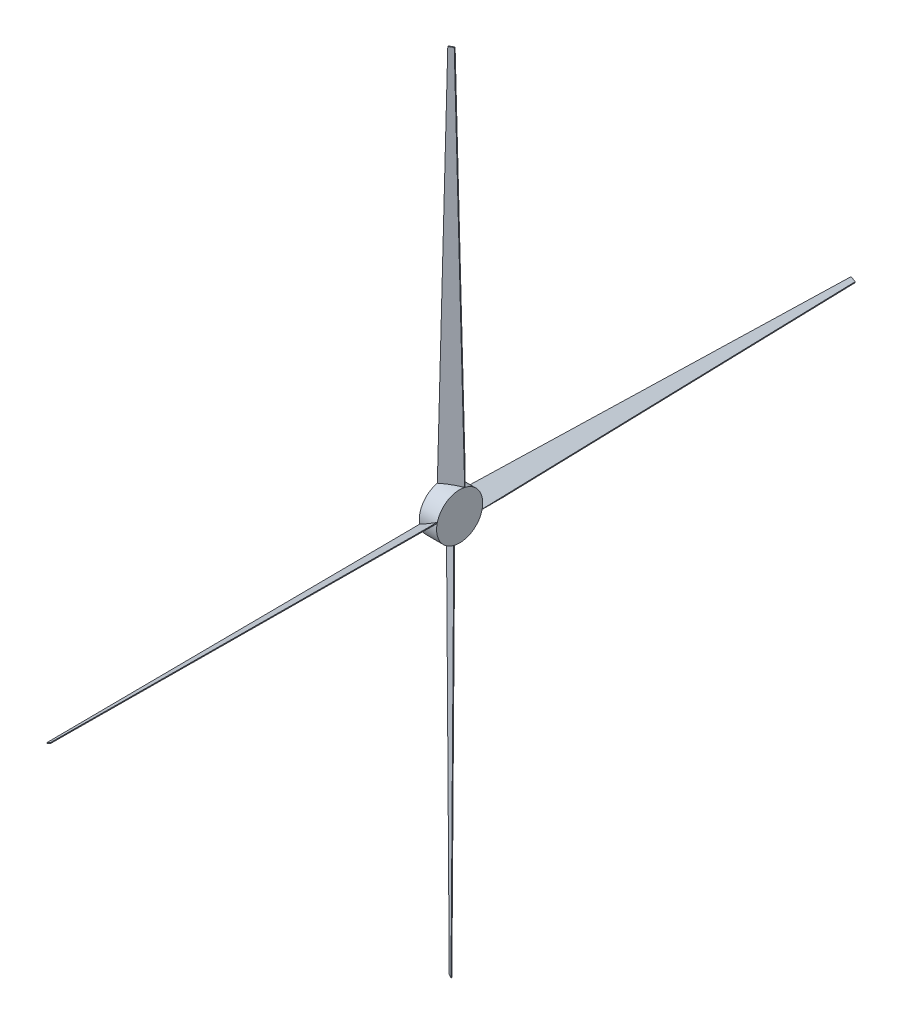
ISO-10303-21;
HEADER;
FILE_DESCRIPTION(('STEP AP214'),'2;1');
FILE_NAME('part.step','',(''),(''),'','','');
FILE_SCHEMA(('AUTOMOTIVE_DESIGN { 1 0 10303 214 1 1 1 1 }'));
ENDSEC;
DATA;
#1=APPLICATION_CONTEXT('core data for automotive mechanical design processes');
#2=APPLICATION_PROTOCOL_DEFINITION('international standard','automotive_design',2000,#1);
#3=PRODUCT_CONTEXT('',#1,'mechanical');
#4=PRODUCT('Part','Part','',(#3));
#5=PRODUCT_RELATED_PRODUCT_CATEGORY('part','',(#4));
#6=PRODUCT_DEFINITION_FORMATION('','',#4);
#7=PRODUCT_DEFINITION_CONTEXT('part definition',#1,'design');
#8=PRODUCT_DEFINITION('design','',#6,#7);
#9=PRODUCT_DEFINITION_SHAPE('','',#8);
#10=(LENGTH_UNIT() NAMED_UNIT(*) SI_UNIT(.MILLI.,.METRE.));
#11=(NAMED_UNIT(*) PLANE_ANGLE_UNIT() SI_UNIT($,.RADIAN.));
#12=(NAMED_UNIT(*) SI_UNIT($,.STERADIAN.) SOLID_ANGLE_UNIT());
#13=UNCERTAINTY_MEASURE_WITH_UNIT(LENGTH_MEASURE(1.E-05),#10,'distance_accuracy_value','');
#14=(GEOMETRIC_REPRESENTATION_CONTEXT(3) GLOBAL_UNCERTAINTY_ASSIGNED_CONTEXT((#13)) GLOBAL_UNIT_ASSIGNED_CONTEXT((#10,
#11,#12)) REPRESENTATION_CONTEXT('',''));
#15=CARTESIAN_POINT('',(0.,0.,0.));
#16=DIRECTION('',(0.,0.,1.));
#17=DIRECTION('',(1.,0.,0.));
#18=AXIS2_PLACEMENT_3D('',#15,#16,#17);
#19=CARTESIAN_POINT('',(27.3049999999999,-18.6974884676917,-1327.15));
#20=DIRECTION('',(0.499999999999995,0.866025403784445,0.));
#21=DIRECTION('',(-0.866025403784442,0.499999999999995,0.));
#22=AXIS2_PLACEMENT_3D('',#19,#20,#21);
#23=PLANE('',#22);
#24=CARTESIAN_POINT('',(27.3051999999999,-18.6976039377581,-147.768558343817));
#25=CARTESIAN_POINT('',(27.090508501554,-18.573651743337,-160.179260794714));
#26=CARTESIAN_POINT('',(26.8754242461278,-18.449472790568,-172.58995416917));
#27=CARTESIAN_POINT('',(26.4447243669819,-18.2008080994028,-197.411328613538));
#28=CARTESIAN_POINT('',(26.2291087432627,-18.0763223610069,-209.822009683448));
#29=CARTESIAN_POINT('',(25.7976002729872,-17.8271908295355,-234.643365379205));
#30=CARTESIAN_POINT('',(25.5817074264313,-17.7025450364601,-247.054040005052));
#31=CARTESIAN_POINT('',(25.1497352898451,-17.4531458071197,-271.875384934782));
#32=CARTESIAN_POINT('',(24.9336559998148,-17.3283923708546,-284.286055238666));
#33=CARTESIAN_POINT('',(24.2852380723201,-16.9540281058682,-321.518061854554));
#34=CARTESIAN_POINT('',(23.8527193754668,-16.7043133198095,-346.339393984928));
#35=CARTESIAN_POINT('',(22.9874367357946,-16.2047421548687,-395.982052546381));
#36=CARTESIAN_POINT('',(22.5546727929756,-15.9548857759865,-420.803378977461));
#37=CARTESIAN_POINT('',(21.2561706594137,-15.2051952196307,-495.267353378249));
#38=CARTESIAN_POINT('',(20.3902221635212,-14.7052396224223,-544.909996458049));
#39=CARTESIAN_POINT('',(18.658096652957,-13.7051964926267,-644.195277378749));
#40=CARTESIAN_POINT('',(17.7919196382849,-13.2051089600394,-693.837915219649));
#41=CARTESIAN_POINT('',(16.0594402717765,-12.2048615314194,-793.123187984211));
#42=CARTESIAN_POINT('',(15.1931379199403,-11.7047016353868,-842.765822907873));
#43=CARTESIAN_POINT('',(13.0623380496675,-10.4744837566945,-964.864369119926));
#44=CARTESIAN_POINT('',(11.7978010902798,-9.74440300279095,-1037.32027949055));
#45=CARTESIAN_POINT('',(9.26864190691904,-8.2841922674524,-1182.23209813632));
#46=CARTESIAN_POINT('',(8.00401968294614,-7.55406228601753,-1254.68800641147));
#47=CARTESIAN_POINT('',(6.73938652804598,-6.82392599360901,-1327.14391443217));
#48=B_SPLINE_CURVE_WITH_KNOTS('',3,(#24,#25,#26,#27,#28,#29,#30,#31,#32,#33,#34,#35,#36,#37,#38,
#39,#40,#41,#42,#43,#44,#45,#46,#47),.UNSPECIFIED.,.F.,.F.,(4,2,2,2,2,2,2,2,2,2,2,4),(0.,
37.2395344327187,74.4790688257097,111.718603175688,148.958137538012,223.43720592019,
297.916274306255,446.87441107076,595.832548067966,744.790685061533,962.202550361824,
1179.61441532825),.UNSPECIFIED.);
#49=CARTESIAN_POINT('',(27.3049999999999,-18.6974884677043,-147.780122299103));
#50=VERTEX_POINT('',#49);
#51=CARTESIAN_POINT('',(6.73958652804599,-6.82404146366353,-1327.13245569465));
#52=VERTEX_POINT('',#51);
#53=EDGE_CURVE('E170',#50,#52,#48,.T.);
#54=ORIENTED_EDGE('',*,*,#53,.F.);
#55=DIRECTION('',(0.,0.,1.));
#56=VECTOR('',#55,1.);
#57=CARTESIAN_POINT('',(27.3049999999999,-18.6974884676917,-1327.15));
#58=LINE('',#57,#56);
#59=CARTESIAN_POINT('',(27.3049999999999,-18.697488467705,-73.8704536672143));
#60=VERTEX_POINT('',#59);
#61=EDGE_CURVE('E300',#50,#60,#58,.T.);
#62=ORIENTED_EDGE('',*,*,#61,.T.);
#63=CARTESIAN_POINT('',(-5.08000000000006,0.,0.));
#64=DIRECTION('',(0.499999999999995,0.866025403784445,0.));
#65=DIRECTION('',(0.866025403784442,-0.499999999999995,0.));
#66=AXIS2_PLACEMENT_3D('',#63,#64,#65);
#67=ELLIPSE('',#66,152.400000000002,76.2);
#68=CARTESIAN_POINT('',(-28.5749999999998,13.5648445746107,-74.9828979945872));
#69=VERTEX_POINT('',#68);
#70=EDGE_CURVE('E320',#69,#60,#67,.F.);
#71=ORIENTED_EDGE('',*,*,#70,.F.);
#72=CARTESIAN_POINT('',(-6.73957699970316,0.958157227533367,-1327.1502));
#73=CARTESIAN_POINT('',(-7.65027176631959,1.4839470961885,-1274.97609677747));
#74=CARTESIAN_POINT('',(-8.56096162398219,2.00973413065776,-1222.8019934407));
#75=CARTESIAN_POINT('',(-10.3823227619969,3.06129747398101,-1118.45378634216));
#76=CARTESIAN_POINT('',(-11.2929940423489,3.587073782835,-1066.27968258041));
#77=CARTESIAN_POINT('',(-13.1143092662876,4.63861061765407,-961.931474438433));
#78=CARTESIAN_POINT('',(-14.0249532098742,5.16437114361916,-909.757370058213));
#79=CARTESIAN_POINT('',(-15.8461965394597,6.21586647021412,-805.409160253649));
#80=CARTESIAN_POINT('',(-16.7567959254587,6.741601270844,-753.235054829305));
#81=CARTESIAN_POINT('',(-18.1226332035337,7.530167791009,-674.973895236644));
#82=CARTESIAN_POINT('',(-18.5779019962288,7.7930173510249,-648.88684178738));
#83=CARTESIAN_POINT('',(-19.4884096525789,8.31869919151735,-596.71273419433));
#84=CARTESIAN_POINT('',(-19.943648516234,8.58153147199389,-570.625680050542));
#85=CARTESIAN_POINT('',(-20.8540820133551,9.10717049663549,-518.451570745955));
#86=CARTESIAN_POINT('',(-21.3092766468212,9.36997724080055,-492.364515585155));
#87=CARTESIAN_POINT('',(-22.2195953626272,9.89554999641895,-440.190403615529));
#88=CARTESIAN_POINT('',(-22.674719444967,10.1583160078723,-414.103346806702));
#89=CARTESIAN_POINT('',(-23.5848489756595,10.6837795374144,-361.929230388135));
#90=CARTESIAN_POINT('',(-24.0398544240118,10.9464770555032,-335.842170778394));
#91=CARTESIAN_POINT('',(-24.7221850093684,11.3404208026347,-296.711577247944));
#92=CARTESIAN_POINT('',(-24.9495989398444,11.4717182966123,-283.668045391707));
#93=CARTESIAN_POINT('',(-25.4043365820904,11.7342611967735,-257.580979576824));
#94=CARTESIAN_POINT('',(-25.6316602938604,11.8655066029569,-244.537445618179));
#95=CARTESIAN_POINT('',(-26.0861645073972,12.12791473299,-218.450374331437));
#96=CARTESIAN_POINT('',(-26.3133450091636,12.2590774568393,-205.406837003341));
#97=CARTESIAN_POINT('',(-26.7674635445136,12.5212629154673,-179.319756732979));
#98=CARTESIAN_POINT('',(-26.9944015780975,12.6522856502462,-166.276213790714));
#99=CARTESIAN_POINT('',(-27.3344474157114,12.8486112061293,-146.710890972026));
#100=CARTESIAN_POINT('',(-27.4477358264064,12.91401830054,-140.189115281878));
#101=CARTESIAN_POINT('',(-27.6741245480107,13.0447238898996,-127.145559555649));
#102=CARTESIAN_POINT('',(-27.7872248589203,13.1100223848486,-120.623779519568));
#103=CARTESIAN_POINT('',(-28.0131445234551,13.2404571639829,-107.58021292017));
#104=CARTESIAN_POINT('',(-28.1259638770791,13.3055934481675,-101.058426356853));
#105=CARTESIAN_POINT('',(-28.3510571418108,13.4355511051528,-88.0148406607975));
#106=CARTESIAN_POINT('',(-28.4633310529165,13.5003724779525,-81.4930415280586));
#107=CARTESIAN_POINT('',(-28.5751999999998,13.5649600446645,-74.9712330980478));
#108=B_SPLINE_CURVE_WITH_KNOTS('',3,(#72,#73,#74,#75,#76,#77,#78,#79,#80,#81,#82,#83,#84,#85,
#86,#87,#88,#89,#90,#91,#92,#93,#94,#95,#96,#97,#98,#99,#100,#101,#102,#103,#104,#105,#106,
#107),.UNSPECIFIED.,.F.,.F.,(4,2,2,2,2,2,2,2,2,2,2,2,2,2,2,2,2,4),(0.,156.554098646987,
313.108197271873,469.66229584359,626.216394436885,704.493443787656,782.770493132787,
861.047542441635,939.324591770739,1017.60164122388,1056.74016591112,1095.87869061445,
1135.01721544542,1174.15574022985,1193.72500272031,1213.29426519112,1232.86352775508,
1252.43279039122),.UNSPECIFIED.);
#109=CARTESIAN_POINT('',(-6.73958652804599,0.958162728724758,-1327.1496541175));
#110=VERTEX_POINT('',#109);
#111=EDGE_CURVE('E295',#110,#69,#108,.T.);
#112=ORIENTED_EDGE('',*,*,#111,.F.);
#113=CARTESIAN_POINT('',(-5.08000000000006,0.,0.));
#114=DIRECTION('',(0.499999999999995,0.866025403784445,0.));
#115=DIRECTION('',(-0.866025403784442,0.499999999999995,0.));
#116=AXIS2_PLACEMENT_3D('',#113,#114,#115);
#117=ELLIPSE('',#116,2654.30000000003,1327.15);
#118=EDGE_CURVE('E162',#52,#110,#117,.T.);
#119=ORIENTED_EDGE('',*,*,#118,.F.);
#120=EDGE_LOOP('',(#54,#62,#71,#112,#119));
#121=FACE_BOUND('',#120,.T.);
#122=ADVANCED_FACE('F17',(#121),#23,.F.);
#123=CARTESIAN_POINT('',(27.3049999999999,-18.6974884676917,-1327.15));
#124=DIRECTION('',(0.866025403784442,-0.499999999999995,0.));
#125=DIRECTION('',(0.499999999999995,0.866025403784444,0.));
#126=AXIS2_PLACEMENT_3D('',#123,#124,#125);
#127=PLANE('',#126);
#128=ORIENTED_EDGE('',*,*,#61,.F.);
#129=CARTESIAN_POINT('',(27.3048845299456,-18.697688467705,-147.786765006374));
#130=CARTESIAN_POINT('',(27.4112065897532,-18.5135332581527,-141.670058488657));
#131=CARTESIAN_POINT('',(27.5174779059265,-18.3294659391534,-135.553348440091));
#132=CARTESIAN_POINT('',(27.7298381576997,-17.9616471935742,-123.319915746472));
#133=CARTESIAN_POINT('',(27.8359270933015,-17.777895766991,-117.203193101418));
#134=CARTESIAN_POINT('',(28.0478416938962,-17.4108489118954,-104.969729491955));
#135=CARTESIAN_POINT('',(28.1536673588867,-17.2275534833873,-98.8529885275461));
#136=CARTESIAN_POINT('',(28.3648221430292,-16.8618226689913,-86.6194722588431));
#137=CARTESIAN_POINT('',(28.4701512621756,-16.6793872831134,-80.5026969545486));
#138=CARTESIAN_POINT('',(28.5751154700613,-16.4975839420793,-74.3858965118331));
#139=B_SPLINE_CURVE_WITH_KNOTS('',3,(#129,#130,#131,#132,#133,#134,#135,#136,#137,#138),
.UNSPECIFIED.,.F.,.F.,(4,2,2,2,4),(0.,18.3612048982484,36.7224095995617,55.0836144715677,
73.4448195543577),.UNSPECIFIED.);
#140=CARTESIAN_POINT('',(28.5750000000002,-16.4977839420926,-74.3926281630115));
#141=VERTEX_POINT('',#140);
#142=EDGE_CURVE('E179',#50,#141,#139,.T.);
#143=ORIENTED_EDGE('',*,*,#142,.T.);
#144=CARTESIAN_POINT('',(38.0999999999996,0.,0.));
#145=DIRECTION('',(0.866025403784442,-0.499999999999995,0.));
#146=DIRECTION('',(0.499999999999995,0.866025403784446,0.));
#147=AXIS2_PLACEMENT_3D('',#144,#145,#146);
#148=ELLIPSE('',#147,87.9881810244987,76.2);
#149=EDGE_CURVE('E304',#141,#60,#148,.F.);
#150=ORIENTED_EDGE('',*,*,#149,.T.);
#151=EDGE_LOOP('',(#128,#143,#150));
#152=FACE_BOUND('',#151,.T.);
#153=ADVANCED_FACE('F210',(#152),#127,.T.);
#154=CARTESIAN_POINT('',(28.5749999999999,-16.4977839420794,-1327.15));
#155=DIRECTION('',(0.499999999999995,0.866025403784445,0.));
#156=DIRECTION('',(-0.866025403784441,0.499999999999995,0.));
#157=AXIS2_PLACEMENT_3D('',#154,#155,#156);
#158=PLANE('',#157);
#159=CARTESIAN_POINT('',(0.,0.,0.));
#160=DIRECTION('',(0.499999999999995,0.866025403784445,0.));
#161=DIRECTION('',(0.866025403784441,-0.499999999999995,0.));
#162=AXIS2_PLACEMENT_3D('',#159,#160,#161);
#163=ELLIPSE('',#162,152.400000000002,76.2);
#164=CARTESIAN_POINT('',(-28.5749999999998,16.497783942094,-74.3926281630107));
#165=VERTEX_POINT('',#164);
#166=EDGE_CURVE('E178',#165,#141,#163,.F.);
#167=ORIENTED_EDGE('',*,*,#166,.T.);
#168=CARTESIAN_POINT('',(28.5750034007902,-16.4977859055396,-74.3924281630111));
#169=CARTESIAN_POINT('',(28.5210164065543,-16.4666164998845,-77.5670500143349));
#170=CARTESIAN_POINT('',(28.46686539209,-16.4353523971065,-80.7416681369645));
#171=CARTESIAN_POINT('',(28.3583102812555,-16.3726780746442,-87.0908986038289));
#172=CARTESIAN_POINT('',(28.3039061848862,-16.3412678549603,-90.2655109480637));
#173=CARTESIAN_POINT('',(28.1404267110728,-16.2468829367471,-99.789341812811));
#174=CARTESIAN_POINT('',(28.0310841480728,-16.1837539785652,-106.138554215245));
#175=CARTESIAN_POINT('',(27.811985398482,-16.0572572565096,-118.836969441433));
#176=CARTESIAN_POINT('',(27.7022292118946,-15.993889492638,-125.186172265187));
#177=CARTESIAN_POINT('',(27.482451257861,-15.8670006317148,-137.884571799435));
#178=CARTESIAN_POINT('',(27.372429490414,-15.8034795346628,-144.23376850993));
#179=CARTESIAN_POINT('',(27.0421031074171,-15.6127655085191,-163.281352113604));
#180=CARTESIAN_POINT('',(26.8215374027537,-15.4854218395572,-175.979732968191));
#181=CARTESIAN_POINT('',(26.380052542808,-15.2305304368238,-201.376486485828));
#182=CARTESIAN_POINT('',(26.1591333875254,-15.1029827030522,-214.074859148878));
#183=CARTESIAN_POINT('',(25.4960722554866,-14.7201641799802,-252.169970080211));
#184=CARTESIAN_POINT('',(25.0536266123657,-14.4647180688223,-277.566701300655));
#185=CARTESIAN_POINT('',(24.1684066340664,-13.9536360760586,-328.360156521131));
#186=CARTESIAN_POINT('',(23.7256322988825,-13.6980001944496,-353.756880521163));
#187=CARTESIAN_POINT('',(22.8399020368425,-13.1866235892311,-404.550324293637));
#188=CARTESIAN_POINT('',(22.3969461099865,-12.9308828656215,-429.947044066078));
#189=CARTESIAN_POINT('',(20.6866733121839,-11.9434564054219,-527.994314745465));
#190=CARTESIAN_POINT('',(19.4190122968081,-11.2115719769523,-600.644857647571));
#191=CARTESIAN_POINT('',(16.8834628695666,-9.74767183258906,-745.945938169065));
#192=CARTESIAN_POINT('',(15.6155744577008,-9.01565611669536,-818.596475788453));
#193=CARTESIAN_POINT('',(13.0796847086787,-7.55155948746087,-963.897545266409));
#194=CARTESIAN_POINT('',(11.8116833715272,-6.8194785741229,-1036.54807712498));
#195=CARTESIAN_POINT('',(9.27561793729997,-5.35528051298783,-1181.84913937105));
#196=CARTESIAN_POINT('',(8.0075538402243,-4.62316336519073,-1254.49966975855));
#197=CARTESIAN_POINT('',(6.7394834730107,-3.89104259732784,-1327.1502));
#198=B_SPLINE_CURVE_WITH_KNOTS('',3,(#168,#169,#170,#171,#172,#173,#174,#175,#176,#177,#178,
#179,#180,#181,#182,#183,#184,#185,#186,#187,#188,#189,#190,#191,#192,#193,#194,#195,#196,#197),
.UNSPECIFIED.,.F.,.F.,(4,2,2,2,2,2,2,2,2,2,2,2,2,2,4),(0.,9.52570154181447,19.0514030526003,
38.1028059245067,57.1542086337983,76.2056113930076,114.308415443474,152.411219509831,
228.616827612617,304.822436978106,381.028046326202,599.023908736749,817.019771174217,
1035.01562421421,1253.0114772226),.UNSPECIFIED.);
#199=CARTESIAN_POINT('',(6.73958652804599,-3.89110209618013,-1327.14429578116));
#200=VERTEX_POINT('',#199);
#201=EDGE_CURVE('E167',#141,#200,#198,.T.);
#202=ORIENTED_EDGE('',*,*,#201,.T.);
#203=CARTESIAN_POINT('',(0.,0.,0.));
#204=DIRECTION('',(0.499999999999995,0.866025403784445,0.));
#205=DIRECTION('',(-0.866025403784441,0.499999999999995,0.));
#206=AXIS2_PLACEMENT_3D('',#203,#204,#205);
#207=ELLIPSE('',#206,2654.30000000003,1327.15);
#208=CARTESIAN_POINT('',(-6.73958652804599,3.89110209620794,-1327.14429578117));
#209=VERTEX_POINT('',#208);
#210=EDGE_CURVE('E152',#200,#209,#207,.T.);
#211=ORIENTED_EDGE('',*,*,#210,.T.);
#212=CARTESIAN_POINT('',(-6.73948347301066,3.89104259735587,-1327.1502));
#213=CARTESIAN_POINT('',(-7.65057473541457,4.41706138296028,-1274.95198921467));
#214=CARTESIAN_POINT('',(-8.56165887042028,4.94307605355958,-1222.75377826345));
#215=CARTESIAN_POINT('',(-10.3838001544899,5.99508981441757,-1118.35735574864));
#216=CARTESIAN_POINT('',(-11.2948573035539,6.52108890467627,-1066.15914418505));
#217=CARTESIAN_POINT('',(-13.1169318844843,7.57306415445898,-961.762720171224));
#218=CARTESIAN_POINT('',(-14.0279493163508,8.09904031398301,-909.564507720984));
#219=CARTESIAN_POINT('',(-15.849919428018,9.15095524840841,-805.168081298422));
#220=CARTESIAN_POINT('',(-16.7608721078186,9.67689402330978,-752.969867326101));
#221=CARTESIAN_POINT('',(-18.127211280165,10.4657503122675,-674.672544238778));
#222=CARTESIAN_POINT('',(-18.582642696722,10.7286937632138,-648.573436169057));
#223=CARTESIAN_POINT('',(-19.4934620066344,11.2545555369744,-596.37521902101));
#224=CARTESIAN_POINT('',(-19.94884989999,11.5174738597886,-570.276109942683));
#225=CARTESIAN_POINT('',(-20.859561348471,12.0432733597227,-518.077890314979));
#226=CARTESIAN_POINT('',(-21.3148849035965,12.3061545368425,-491.9787797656));
#227=CARTESIAN_POINT('',(-22.2254293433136,12.8318576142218,-439.780556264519));
#228=CARTESIAN_POINT('',(-22.6806502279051,13.0946795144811,-413.681443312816));
#229=CARTESIAN_POINT('',(-23.5909192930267,13.6202236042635,-361.483213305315));
#230=CARTESIAN_POINT('',(-24.0459674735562,13.8829457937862,-335.384096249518));
#231=CARTESIAN_POINT('',(-24.7282809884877,14.2768796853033,-296.235414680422));
#232=CARTESIAN_POINT('',(-24.9556757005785,14.408166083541,-283.185853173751));
#233=CARTESIAN_POINT('',(-25.4103336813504,14.6706629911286,-257.086727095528));
#234=CARTESIAN_POINT('',(-25.6375969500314,14.8018735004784,-244.037162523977));
#235=CARTESIAN_POINT('',(-26.0919144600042,15.0641738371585,-217.938028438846));
#236=CARTESIAN_POINT('',(-26.3189687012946,15.195263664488,-204.888458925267));
#237=CARTESIAN_POINT('',(-26.7727242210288,15.4572395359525,-178.789311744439));
#238=CARTESIAN_POINT('',(-26.9994254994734,15.5881255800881,-165.73973407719));
#239=CARTESIAN_POINT('',(-27.3389481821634,15.7841490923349,-146.165355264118));
#240=CARTESIAN_POINT('',(-27.4520342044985,15.8494393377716,-139.640560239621));
#241=CARTESIAN_POINT('',(-27.6779356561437,15.9798636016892,-126.590963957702));
#242=CARTESIAN_POINT('',(-27.7907510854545,16.0449976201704,-120.06616270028));
#243=CARTESIAN_POINT('',(-28.0159574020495,16.1750205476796,-107.016550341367));
#244=CARTESIAN_POINT('',(-28.1283482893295,16.2399094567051,-100.491739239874));
#245=CARTESIAN_POINT('',(-28.2963801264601,16.3369226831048,-90.704509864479));
#246=CARTESIAN_POINT('',(-28.3522983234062,16.3692070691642,-87.4420979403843));
#247=CARTESIAN_POINT('',(-28.4638696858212,16.4336228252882,-80.9172680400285));
#248=CARTESIAN_POINT('',(-28.5195228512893,16.4657541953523,-77.6548500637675));
#249=CARTESIAN_POINT('',(-28.5750034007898,16.497785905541,-74.3924281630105));
#250=B_SPLINE_CURVE_WITH_KNOTS('',3,(#212,#213,#214,#215,#216,#217,#218,#219,#220,#221,#222,
#223,#224,#225,#226,#227,#228,#229,#230,#231,#232,#233,#234,#235,#236,#237,#238,#239,#240,#241,
#242,#243,#244,#245,#246,#247,#248,#249),.UNSPECIFIED.,.F.,.F.,(4,2,2,2,2,2,2,2,2,2,2,2,2,2,2,2,
2,2,4),(0.,156.626434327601,313.252868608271,469.879302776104,626.505736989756,704.818954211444,
783.132171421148,861.445388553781,939.75860572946,1018.07182316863,1057.22843180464,
1096.38504047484,1135.5416494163,1174.69825825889,1194.27656288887,1213.85486747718,
1233.43317226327,1243.22232472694,1253.01147722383),.UNSPECIFIED.);
#251=EDGE_CURVE('E291',#209,#165,#250,.T.);
#252=ORIENTED_EDGE('',*,*,#251,.T.);
#253=EDGE_LOOP('',(#167,#202,#211,#252));
#254=FACE_BOUND('',#253,.T.);
#255=ADVANCED_FACE('F176',(#254),#158,.T.);
#256=CARTESIAN_POINT('',(27.3049999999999,-1327.15,18.6974884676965));
#257=DIRECTION('',(0.499999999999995,0.,-0.866025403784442));
#258=DIRECTION('',(-0.866025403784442,0.,-0.499999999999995));
#259=AXIS2_PLACEMENT_3D('',#256,#257,#258);
#260=PLANE('',#259);
#261=CARTESIAN_POINT('',(27.3051999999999,-147.768558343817,18.6976039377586));
#262=CARTESIAN_POINT('',(27.090508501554,-160.179260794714,18.5736517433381));
#263=CARTESIAN_POINT('',(26.8754242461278,-172.58995416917,18.4494727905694));
#264=CARTESIAN_POINT('',(26.4447243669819,-197.411328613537,18.2008080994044));
#265=CARTESIAN_POINT('',(26.2291087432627,-209.822009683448,18.0763223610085));
#266=CARTESIAN_POINT('',(25.7976002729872,-234.643365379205,17.8271908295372));
#267=CARTESIAN_POINT('',(25.5817074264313,-247.054040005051,17.702545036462));
#268=CARTESIAN_POINT('',(25.1497352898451,-271.875384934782,17.4531458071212));
#269=CARTESIAN_POINT('',(24.9336559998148,-284.286055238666,17.3283923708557));
#270=CARTESIAN_POINT('',(24.2852380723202,-321.518061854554,16.954028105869));
#271=CARTESIAN_POINT('',(23.8527193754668,-346.339393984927,16.7043133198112));
#272=CARTESIAN_POINT('',(22.9874367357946,-395.982052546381,16.2047421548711));
#273=CARTESIAN_POINT('',(22.5546727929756,-420.803378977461,15.9548857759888));
#274=CARTESIAN_POINT('',(21.2561706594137,-495.267353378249,15.2051952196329));
#275=CARTESIAN_POINT('',(20.3902221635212,-544.909996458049,14.7052396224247));
#276=CARTESIAN_POINT('',(18.658096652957,-644.195277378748,13.7051964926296));
#277=CARTESIAN_POINT('',(17.7919196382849,-693.837915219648,13.2051089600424));
#278=CARTESIAN_POINT('',(16.0594402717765,-793.123187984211,12.2048615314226));
#279=CARTESIAN_POINT('',(15.1931379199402,-842.765822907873,11.7047016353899));
#280=CARTESIAN_POINT('',(13.0623380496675,-964.864369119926,10.4744837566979));
#281=CARTESIAN_POINT('',(11.7978010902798,-1037.32027949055,9.74440300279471));
#282=CARTESIAN_POINT('',(9.26864190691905,-1182.23209813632,8.28419226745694));
#283=CARTESIAN_POINT('',(8.00401968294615,-1254.68800641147,7.55406228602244));
#284=CARTESIAN_POINT('',(6.73938652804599,-1327.14391443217,6.82392599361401));
#285=B_SPLINE_CURVE_WITH_KNOTS('',3,(#261,#262,#263,#264,#265,#266,#267,#268,#269,#270,#271,
#272,#273,#274,#275,#276,#277,#278,#279,#280,#281,#282,#283,#284),.UNSPECIFIED.,.F.,.F.,(4,2,2,
2,2,2,2,2,2,2,2,4),(0.,37.2395344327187,74.4790688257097,111.718603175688,148.958137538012,
223.43720592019,297.916274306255,446.87441107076,595.832548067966,744.790685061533,
962.202550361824,1179.61441532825),.UNSPECIFIED.);
#286=CARTESIAN_POINT('',(27.3049999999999,-147.780122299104,18.6974884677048));
#287=VERTEX_POINT('',#286);
#288=CARTESIAN_POINT('',(6.73958652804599,-1327.13245569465,6.82404146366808));
#289=VERTEX_POINT('',#288);
#290=EDGE_CURVE('E180',#287,#289,#285,.T.);
#291=ORIENTED_EDGE('',*,*,#290,.F.);
#292=DIRECTION('',(0.,1.,0.));
#293=VECTOR('',#292,1.);
#294=CARTESIAN_POINT('',(27.3049999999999,-1327.15,18.6974884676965));
#295=LINE('',#294,#293);
#296=CARTESIAN_POINT('',(27.3049999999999,-73.8704536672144,18.6974884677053));
#297=VERTEX_POINT('',#296);
#298=EDGE_CURVE('E45',#287,#297,#295,.T.);
#299=ORIENTED_EDGE('',*,*,#298,.T.);
#300=CARTESIAN_POINT('',(-5.08000000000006,0.,0.));
#301=DIRECTION('',(0.499999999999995,0.,-0.866025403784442));
#302=DIRECTION('',(0.866025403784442,0.,0.499999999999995));
#303=AXIS2_PLACEMENT_3D('',#300,#301,#302);
#304=ELLIPSE('',#303,152.400000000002,76.2);
#305=CARTESIAN_POINT('',(-28.5749999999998,-74.9828979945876,-13.5648445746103));
#306=VERTEX_POINT('',#305);
#307=EDGE_CURVE('E323',#306,#297,#304,.F.);
#308=ORIENTED_EDGE('',*,*,#307,.F.);
#309=CARTESIAN_POINT('',(-6.73957699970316,-1327.1502,-0.958157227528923));
#310=CARTESIAN_POINT('',(-7.65027176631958,-1274.97609677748,-1.48394709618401));
#311=CARTESIAN_POINT('',(-8.56096162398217,-1222.8019934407,-2.00973413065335));
#312=CARTESIAN_POINT('',(-10.3823227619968,-1118.45378634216,-3.06129747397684));
#313=CARTESIAN_POINT('',(-11.2929940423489,-1066.27968258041,-3.58707378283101));
#314=CARTESIAN_POINT('',(-13.1143092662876,-961.931474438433,-4.6386106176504));
#315=CARTESIAN_POINT('',(-14.0249532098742,-909.757370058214,-5.16437114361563));
#316=CARTESIAN_POINT('',(-15.8461965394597,-805.40916025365,-6.2158664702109));
#317=CARTESIAN_POINT('',(-16.7567959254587,-753.235054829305,-6.74160127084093));
#318=CARTESIAN_POINT('',(-18.1226332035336,-674.973895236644,-7.53016779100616));
#319=CARTESIAN_POINT('',(-18.5779019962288,-648.886841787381,-7.79301735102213));
#320=CARTESIAN_POINT('',(-19.4884096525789,-596.71273419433,-8.31869919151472));
#321=CARTESIAN_POINT('',(-19.943648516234,-570.625680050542,-8.58153147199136));
#322=CARTESIAN_POINT('',(-20.8540820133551,-518.451570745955,-9.10717049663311));
#323=CARTESIAN_POINT('',(-21.3092766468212,-492.364515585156,-9.36997724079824));
#324=CARTESIAN_POINT('',(-22.2195953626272,-440.19040361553,-9.89554999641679));
#325=CARTESIAN_POINT('',(-22.674719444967,-414.103346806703,-10.1583160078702));
#326=CARTESIAN_POINT('',(-23.5848489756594,-361.929230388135,-10.6837795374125));
#327=CARTESIAN_POINT('',(-24.0398544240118,-335.842170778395,-10.9464770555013));
#328=CARTESIAN_POINT('',(-24.7221850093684,-296.711577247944,-11.340420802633));
#329=CARTESIAN_POINT('',(-24.9495989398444,-283.668045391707,-11.4717182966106));
#330=CARTESIAN_POINT('',(-25.4043365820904,-257.580979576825,-11.7342611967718));
#331=CARTESIAN_POINT('',(-25.6316602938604,-244.537445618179,-11.8655066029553));
#332=CARTESIAN_POINT('',(-26.0861645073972,-218.450374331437,-12.1279147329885));
#333=CARTESIAN_POINT('',(-26.3133450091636,-205.406837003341,-12.2590774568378));
#334=CARTESIAN_POINT('',(-26.7674635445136,-179.319756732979,-12.5212629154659));
#335=CARTESIAN_POINT('',(-26.9944015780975,-166.276213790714,-12.6522856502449));
#336=CARTESIAN_POINT('',(-27.3344474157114,-146.710890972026,-12.848611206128));
#337=CARTESIAN_POINT('',(-27.4477358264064,-140.189115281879,-12.9140183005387));
#338=CARTESIAN_POINT('',(-27.6741245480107,-127.14555955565,-13.0447238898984));
#339=CARTESIAN_POINT('',(-27.7872248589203,-120.623779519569,-13.1100223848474));
#340=CARTESIAN_POINT('',(-28.0131445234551,-107.58021292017,-13.2404571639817));
#341=CARTESIAN_POINT('',(-28.1259638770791,-101.058426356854,-13.3055934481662));
#342=CARTESIAN_POINT('',(-28.3510571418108,-88.0148406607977,-13.4355511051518));
#343=CARTESIAN_POINT('',(-28.4633310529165,-81.4930415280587,-13.5003724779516));
#344=CARTESIAN_POINT('',(-28.5751999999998,-74.971233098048,-13.5649600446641));
#345=B_SPLINE_CURVE_WITH_KNOTS('',3,(#309,#310,#311,#312,#313,#314,#315,#316,#317,#318,#319,
#320,#321,#322,#323,#324,#325,#326,#327,#328,#329,#330,#331,#332,#333,#334,#335,#336,#337,#338,
#339,#340,#341,#342,#343,#344),.UNSPECIFIED.,.F.,.F.,(4,2,2,2,2,2,2,2,2,2,2,2,2,2,2,2,2,4),(0.,
156.554098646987,313.108197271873,469.662295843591,626.216394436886,704.493443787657,
782.770493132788,861.047542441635,939.32459177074,1017.60164122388,1056.74016591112,
1095.87869061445,1135.01721544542,1174.15574022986,1193.72500272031,1213.29426519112,
1232.86352775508,1252.43279039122),.UNSPECIFIED.);
#346=CARTESIAN_POINT('',(-6.73958652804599,-1327.14965411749,-0.958162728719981));
#347=VERTEX_POINT('',#346);
#348=EDGE_CURVE('E265',#347,#306,#345,.T.);
#349=ORIENTED_EDGE('',*,*,#348,.F.);
#350=CARTESIAN_POINT('',(-5.08000000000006,0.,0.));
#351=DIRECTION('',(0.499999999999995,0.,-0.866025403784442));
#352=DIRECTION('',(-0.866025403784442,0.,-0.499999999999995));
#353=AXIS2_PLACEMENT_3D('',#350,#351,#352);
#354=ELLIPSE('',#353,2654.30000000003,1327.15);
#355=EDGE_CURVE('E163',#289,#347,#354,.T.);
#356=ORIENTED_EDGE('',*,*,#355,.F.);
#357=EDGE_LOOP('',(#291,#299,#308,#349,#356));
#358=FACE_BOUND('',#357,.T.);
#359=ADVANCED_FACE('F248',(#358),#260,.F.);
#360=CARTESIAN_POINT('',(27.3049999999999,-1327.15,18.6974884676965));
#361=DIRECTION('',(0.866025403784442,0.,0.499999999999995));
#362=DIRECTION('',(0.499999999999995,0.,-0.866025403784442));
#363=AXIS2_PLACEMENT_3D('',#360,#361,#362);
#364=PLANE('',#363);
#365=ORIENTED_EDGE('',*,*,#298,.F.);
#366=CARTESIAN_POINT('',(27.3048845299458,-147.786765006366,18.6976884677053));
#367=CARTESIAN_POINT('',(27.4112065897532,-141.670058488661,18.5135332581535));
#368=CARTESIAN_POINT('',(27.5174779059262,-135.553348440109,18.3294659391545));
#369=CARTESIAN_POINT('',(27.7298381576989,-123.319915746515,17.9616471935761));
#370=CARTESIAN_POINT('',(27.8359270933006,-117.203193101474,17.7778957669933));
#371=CARTESIAN_POINT('',(28.0478416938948,-104.969729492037,17.4108489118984));
#372=CARTESIAN_POINT('',(28.153667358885,-98.8529885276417,17.2275534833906));
#373=CARTESIAN_POINT('',(28.3648221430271,-86.6194722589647,16.8618226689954));
#374=CARTESIAN_POINT('',(28.4701512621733,-80.5026969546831,16.6793872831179));
#375=CARTESIAN_POINT('',(28.5751154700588,-74.3858965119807,16.4975839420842));
#376=B_SPLINE_CURVE_WITH_KNOTS('',3,(#366,#367,#368,#369,#370,#371,#372,#373,#374,#375),
.UNSPECIFIED.,.F.,.F.,(4,2,2,2,4),(0.,18.3612048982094,36.7224095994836,55.0836144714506,
73.4448195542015),.UNSPECIFIED.);
#377=CARTESIAN_POINT('',(28.5750000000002,-74.3926281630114,16.4977839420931));
#378=VERTEX_POINT('',#377);
#379=EDGE_CURVE('E183',#287,#378,#376,.T.);
#380=ORIENTED_EDGE('',*,*,#379,.T.);
#381=CARTESIAN_POINT('',(38.0999999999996,0.,0.));
#382=DIRECTION('',(0.866025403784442,0.,0.499999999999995));
#383=DIRECTION('',(0.499999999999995,0.,-0.866025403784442));
#384=AXIS2_PLACEMENT_3D('',#381,#382,#383);
#385=ELLIPSE('',#384,87.9881810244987,76.2);
#386=EDGE_CURVE('E308',#378,#297,#385,.F.);
#387=ORIENTED_EDGE('',*,*,#386,.T.);
#388=EDGE_LOOP('',(#365,#380,#387));
#389=FACE_BOUND('',#388,.T.);
#390=ADVANCED_FACE('F244',(#389),#364,.T.);
#391=CARTESIAN_POINT('',(28.5749999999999,-1327.15,16.4977839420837));
#392=DIRECTION('',(0.499999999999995,0.,-0.866025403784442));
#393=DIRECTION('',(-0.866025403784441,0.,-0.499999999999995));
#394=AXIS2_PLACEMENT_3D('',#391,#392,#393);
#395=PLANE('',#394);
#396=CARTESIAN_POINT('',(0.,0.,0.));
#397=DIRECTION('',(0.499999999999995,0.,-0.866025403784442));
#398=DIRECTION('',(0.866025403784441,0.,0.499999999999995));
#399=AXIS2_PLACEMENT_3D('',#396,#397,#398);
#400=ELLIPSE('',#399,152.400000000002,76.2);
#401=CARTESIAN_POINT('',(-28.5749999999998,-74.3926281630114,-16.4977839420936));
#402=VERTEX_POINT('',#401);
#403=EDGE_CURVE('E311',#402,#378,#400,.F.);
#404=ORIENTED_EDGE('',*,*,#403,.T.);
#405=CARTESIAN_POINT('',(28.5750034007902,-74.3924281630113,16.4977859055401));
#406=CARTESIAN_POINT('',(28.5210164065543,-77.5670500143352,16.4666164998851));
#407=CARTESIAN_POINT('',(28.46686539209,-80.7416681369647,16.4353523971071));
#408=CARTESIAN_POINT('',(28.3583102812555,-87.0908986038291,16.3726780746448));
#409=CARTESIAN_POINT('',(28.3039061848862,-90.265510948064,16.341267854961));
#410=CARTESIAN_POINT('',(28.1404267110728,-99.7893418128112,16.2468829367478));
#411=CARTESIAN_POINT('',(28.0310841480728,-106.138554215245,16.1837539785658));
#412=CARTESIAN_POINT('',(27.811985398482,-118.836969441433,16.0572572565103));
#413=CARTESIAN_POINT('',(27.7022292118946,-125.186172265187,15.9938894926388));
#414=CARTESIAN_POINT('',(27.482451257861,-137.884571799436,15.8670006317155));
#415=CARTESIAN_POINT('',(27.372429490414,-144.23376850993,15.8034795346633));
#416=CARTESIAN_POINT('',(27.0421031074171,-163.281352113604,15.6127655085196));
#417=CARTESIAN_POINT('',(26.8215374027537,-175.979732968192,15.4854218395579));
#418=CARTESIAN_POINT('',(26.3800525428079,-201.376486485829,15.2305304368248));
#419=CARTESIAN_POINT('',(26.1591333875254,-214.074859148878,15.1029827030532));
#420=CARTESIAN_POINT('',(25.4960722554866,-252.169970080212,14.7201641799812));
#421=CARTESIAN_POINT('',(25.0536266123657,-277.566701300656,14.4647180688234));
#422=CARTESIAN_POINT('',(24.1684066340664,-328.360156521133,13.9536360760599));
#423=CARTESIAN_POINT('',(23.7256322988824,-353.756880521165,13.698000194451));
#424=CARTESIAN_POINT('',(22.8399020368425,-404.550324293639,13.1866235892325));
#425=CARTESIAN_POINT('',(22.3969461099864,-429.94704406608,12.930882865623));
#426=CARTESIAN_POINT('',(20.6866733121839,-527.994314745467,11.9434564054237));
#427=CARTESIAN_POINT('',(19.419012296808,-600.644857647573,11.2115719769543));
#428=CARTESIAN_POINT('',(16.8834628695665,-745.945938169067,9.74767183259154));
#429=CARTESIAN_POINT('',(15.6155744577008,-818.596475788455,9.01565611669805));
#430=CARTESIAN_POINT('',(13.0796847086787,-963.897545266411,7.55155948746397));
#431=CARTESIAN_POINT('',(11.8116833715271,-1036.54807712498,6.81947857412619));
#432=CARTESIAN_POINT('',(9.27561793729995,-1181.84913937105,5.35528051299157));
#433=CARTESIAN_POINT('',(8.00755384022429,-1254.49966975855,4.62316336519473));
#434=CARTESIAN_POINT('',(6.7394834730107,-1327.1502,3.89104259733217));
#435=B_SPLINE_CURVE_WITH_KNOTS('',3,(#405,#406,#407,#408,#409,#410,#411,#412,#413,#414,#415,
#416,#417,#418,#419,#420,#421,#422,#423,#424,#425,#426,#427,#428,#429,#430,#431,#432,#433,#434),
.UNSPECIFIED.,.F.,.F.,(4,2,2,2,2,2,2,2,2,2,2,2,2,2,4),(0.,9.52570154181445,19.0514030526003,
38.1028059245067,57.1542086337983,76.2056113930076,114.308415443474,152.411219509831,
228.616827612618,304.822436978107,381.028046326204,599.023908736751,817.019771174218,
1035.01562421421,1253.0114772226),.UNSPECIFIED.);
#436=CARTESIAN_POINT('',(6.73958652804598,-1327.14429578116,3.89110209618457));
#437=VERTEX_POINT('',#436);
#438=EDGE_CURVE('E232',#378,#437,#435,.T.);
#439=ORIENTED_EDGE('',*,*,#438,.T.);
#440=CARTESIAN_POINT('',(0.,0.,0.));
#441=DIRECTION('',(0.499999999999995,0.,-0.866025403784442));
#442=DIRECTION('',(-0.866025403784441,0.,-0.499999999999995));
#443=AXIS2_PLACEMENT_3D('',#440,#441,#442);
#444=ELLIPSE('',#443,2654.30000000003,1327.15);
#445=CARTESIAN_POINT('',(-6.73958652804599,-1327.14429578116,-3.89110209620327));
#446=VERTEX_POINT('',#445);
#447=EDGE_CURVE('E500',#437,#446,#444,.T.);
#448=ORIENTED_EDGE('',*,*,#447,.T.);
#449=CARTESIAN_POINT('',(-6.73948347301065,-1327.1502,-3.89104259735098));
#450=CARTESIAN_POINT('',(-7.65057473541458,-1274.95198921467,-4.41706138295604));
#451=CARTESIAN_POINT('',(-8.56165887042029,-1222.75377826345,-4.94307605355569));
#452=CARTESIAN_POINT('',(-10.3838001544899,-1118.35735574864,-5.99508981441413));
#453=CARTESIAN_POINT('',(-11.2948573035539,-1066.15914418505,-6.52108890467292));
#454=CARTESIAN_POINT('',(-13.1169318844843,-961.762720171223,-7.5730641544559));
#455=CARTESIAN_POINT('',(-14.0279493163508,-909.564507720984,-8.0990403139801));
#456=CARTESIAN_POINT('',(-15.849919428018,-805.168081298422,-9.15095524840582));
#457=CARTESIAN_POINT('',(-16.7608721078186,-752.9698673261,-9.67689402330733));
#458=CARTESIAN_POINT('',(-18.127211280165,-674.672544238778,-10.4657503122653));
#459=CARTESIAN_POINT('',(-18.582642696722,-648.573436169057,-10.7286937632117));
#460=CARTESIAN_POINT('',(-19.4934620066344,-596.37521902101,-11.2545555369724));
#461=CARTESIAN_POINT('',(-19.94884989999,-570.276109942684,-11.5174738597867));
#462=CARTESIAN_POINT('',(-20.859561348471,-518.077890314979,-12.0432733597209));
#463=CARTESIAN_POINT('',(-21.3148849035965,-491.978779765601,-12.3061545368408));
#464=CARTESIAN_POINT('',(-22.2254293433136,-439.780556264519,-12.8318576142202));
#465=CARTESIAN_POINT('',(-22.6806502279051,-413.681443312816,-13.0946795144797));
#466=CARTESIAN_POINT('',(-23.5909192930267,-361.483213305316,-13.6202236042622));
#467=CARTESIAN_POINT('',(-24.0459674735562,-335.384096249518,-13.882945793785));
#468=CARTESIAN_POINT('',(-24.7282809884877,-296.235414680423,-14.2768796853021));
#469=CARTESIAN_POINT('',(-24.9556757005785,-283.185853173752,-14.40816608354));
#470=CARTESIAN_POINT('',(-25.4103336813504,-257.086727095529,-14.6706629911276));
#471=CARTESIAN_POINT('',(-25.6375969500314,-244.037162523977,-14.8018735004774));
#472=CARTESIAN_POINT('',(-26.0919144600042,-217.938028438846,-15.0641738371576));
#473=CARTESIAN_POINT('',(-26.3189687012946,-204.888458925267,-15.1952636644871));
#474=CARTESIAN_POINT('',(-26.7727242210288,-178.789311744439,-15.4572395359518));
#475=CARTESIAN_POINT('',(-26.9994254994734,-165.739734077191,-15.5881255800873));
#476=CARTESIAN_POINT('',(-27.3389481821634,-146.165355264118,-15.7841490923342));
#477=CARTESIAN_POINT('',(-27.4520342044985,-139.640560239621,-15.8494393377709));
#478=CARTESIAN_POINT('',(-27.6779356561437,-126.590963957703,-15.9798636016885));
#479=CARTESIAN_POINT('',(-27.7907510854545,-120.066162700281,-16.0449976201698));
#480=CARTESIAN_POINT('',(-28.0159574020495,-107.016550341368,-16.175020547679));
#481=CARTESIAN_POINT('',(-28.1283482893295,-100.491739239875,-16.2399094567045));
#482=CARTESIAN_POINT('',(-28.2963801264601,-90.7045098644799,-16.3369226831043));
#483=CARTESIAN_POINT('',(-28.3522983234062,-87.4420979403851,-16.3692070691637));
#484=CARTESIAN_POINT('',(-28.4638696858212,-80.9172680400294,-16.4336228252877));
#485=CARTESIAN_POINT('',(-28.5195228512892,-77.6548500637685,-16.4657541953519));
#486=CARTESIAN_POINT('',(-28.5750034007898,-74.3924281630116,-16.4977859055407));
#487=B_SPLINE_CURVE_WITH_KNOTS('',3,(#449,#450,#451,#452,#453,#454,#455,#456,#457,#458,#459,
#460,#461,#462,#463,#464,#465,#466,#467,#468,#469,#470,#471,#472,#473,#474,#475,#476,#477,#478,
#479,#480,#481,#482,#483,#484,#485,#486),.UNSPECIFIED.,.F.,.F.,(4,2,2,2,2,2,2,2,2,2,2,2,2,2,2,2,
2,2,4),(0.,156.6264343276,313.252868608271,469.879302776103,626.505736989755,704.818954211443,
783.132171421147,861.44538855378,939.758605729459,1018.07182316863,1057.22843180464,
1096.38504047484,1135.5416494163,1174.69825825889,1194.27656288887,1213.85486747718,
1233.43317226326,1243.22232472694,1253.01147722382),.UNSPECIFIED.);
#488=EDGE_CURVE('E258',#446,#402,#487,.T.);
#489=ORIENTED_EDGE('',*,*,#488,.T.);
#490=EDGE_LOOP('',(#404,#439,#448,#489));
#491=FACE_BOUND('',#490,.T.);
#492=ADVANCED_FACE('F247',(#491),#395,.T.);
#493=CARTESIAN_POINT('',(28.5749999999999,16.4977839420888,1327.15));
#494=DIRECTION('',(0.499999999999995,-0.866025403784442,0.));
#495=DIRECTION('',(0.866025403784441,0.499999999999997,0.));
#496=AXIS2_PLACEMENT_3D('',#493,#494,#495);
#497=PLANE('',#496);
#498=CARTESIAN_POINT('',(0.,0.,0.));
#499=DIRECTION('',(0.499999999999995,-0.866025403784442,0.));
#500=DIRECTION('',(0.866025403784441,0.499999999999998,0.));
#501=AXIS2_PLACEMENT_3D('',#498,#499,#500);
#502=ELLIPSE('',#501,152.400000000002,76.2);
#503=CARTESIAN_POINT('',(-28.5749999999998,-16.4977839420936,74.3926281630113));
#504=VERTEX_POINT('',#503);
#505=CARTESIAN_POINT('',(28.5750000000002,16.4977839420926,74.3926281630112));
#506=VERTEX_POINT('',#505);
#507=EDGE_CURVE('E317',#504,#506,#502,.F.);
#508=ORIENTED_EDGE('',*,*,#507,.T.);
#509=CARTESIAN_POINT('',(28.5750034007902,16.4977859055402,74.3924281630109));
#510=CARTESIAN_POINT('',(28.5210164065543,16.4666164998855,77.5670500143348));
#511=CARTESIAN_POINT('',(28.46686539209,16.4353523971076,80.7416681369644));
#512=CARTESIAN_POINT('',(28.3583102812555,16.3726780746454,87.0908986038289));
#513=CARTESIAN_POINT('',(28.3039061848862,16.3412678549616,90.2655109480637));
#514=CARTESIAN_POINT('',(28.1404267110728,16.2468829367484,99.789341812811));
#515=CARTESIAN_POINT('',(28.0310841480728,16.1837539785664,106.138554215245));
#516=CARTESIAN_POINT('',(27.811985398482,16.057257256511,118.836969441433));
#517=CARTESIAN_POINT('',(27.7022292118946,15.9938894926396,125.186172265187));
#518=CARTESIAN_POINT('',(27.482451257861,15.8670006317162,137.884571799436));
#519=CARTESIAN_POINT('',(27.372429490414,15.8034795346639,144.23376850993));
#520=CARTESIAN_POINT('',(27.042103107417,15.6127655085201,163.281352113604));
#521=CARTESIAN_POINT('',(26.8215374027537,15.4854218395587,175.979732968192));
#522=CARTESIAN_POINT('',(26.380052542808,15.2305304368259,201.376486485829));
#523=CARTESIAN_POINT('',(26.1591333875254,15.1029827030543,214.074859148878));
#524=CARTESIAN_POINT('',(25.4960722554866,14.7201641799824,252.169970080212));
#525=CARTESIAN_POINT('',(25.0536266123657,14.4647180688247,277.566701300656));
#526=CARTESIAN_POINT('',(24.1684066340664,13.9536360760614,328.360156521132));
#527=CARTESIAN_POINT('',(23.7256322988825,13.6980001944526,353.756880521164));
#528=CARTESIAN_POINT('',(22.8399020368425,13.1866235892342,404.550324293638));
#529=CARTESIAN_POINT('',(22.3969461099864,12.9308828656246,429.947044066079));
#530=CARTESIAN_POINT('',(20.6866733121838,11.9434564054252,527.994314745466));
#531=CARTESIAN_POINT('',(19.419012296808,11.2115719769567,600.644857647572));
#532=CARTESIAN_POINT('',(16.8834628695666,9.74767183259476,745.945938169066));
#533=CARTESIAN_POINT('',(15.6155744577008,9.01565611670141,818.596475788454));
#534=CARTESIAN_POINT('',(13.0796847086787,7.55155948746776,963.89754526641));
#535=CARTESIAN_POINT('',(11.8116833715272,6.81947857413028,1036.54807712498));
#536=CARTESIAN_POINT('',(9.27561793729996,5.35528051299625,1181.84913937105));
#537=CARTESIAN_POINT('',(8.0075538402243,4.62316336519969,1254.49966975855));
#538=CARTESIAN_POINT('',(6.7394834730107,3.89104259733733,1327.1502));
#539=B_SPLINE_CURVE_WITH_KNOTS('',3,(#509,#510,#511,#512,#513,#514,#515,#516,#517,#518,#519,
#520,#521,#522,#523,#524,#525,#526,#527,#528,#529,#530,#531,#532,#533,#534,#535,#536,#537,#538),
.UNSPECIFIED.,.F.,.F.,(4,2,2,2,2,2,2,2,2,2,2,2,2,2,4),(0.,9.52570154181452,19.0514030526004,
38.1028059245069,57.1542086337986,76.205611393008,114.308415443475,152.411219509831,
228.616827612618,304.822436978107,381.028046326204,599.02390873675,817.019771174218,
1035.01562421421,1253.0114772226),.UNSPECIFIED.);
#540=CARTESIAN_POINT('',(6.73958652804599,3.89110209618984,1327.14429578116));
#541=VERTEX_POINT('',#540);
#542=EDGE_CURVE('E225',#506,#541,#539,.T.);
#543=ORIENTED_EDGE('',*,*,#542,.T.);
#544=CARTESIAN_POINT('',(0.,0.,0.));
#545=DIRECTION('',(0.499999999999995,-0.866025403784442,0.));
#546=DIRECTION('',(-0.866025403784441,-0.499999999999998,0.));
#547=AXIS2_PLACEMENT_3D('',#544,#545,#546);
#548=ELLIPSE('',#547,2654.30000000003,1327.15);
#549=CARTESIAN_POINT('',(-6.73958652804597,-3.89110209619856,1327.14429578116));
#550=VERTEX_POINT('',#549);
#551=EDGE_CURVE('E486',#541,#550,#548,.T.);
#552=ORIENTED_EDGE('',*,*,#551,.T.);
#553=CARTESIAN_POINT('',(-6.73948347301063,-3.89104259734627,1327.1502));
#554=CARTESIAN_POINT('',(-7.65057473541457,-4.41706138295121,1274.95198921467));
#555=CARTESIAN_POINT('',(-8.56165887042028,-4.94307605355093,1222.75377826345));
#556=CARTESIAN_POINT('',(-10.3838001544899,-5.99508981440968,1118.35735574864));
#557=CARTESIAN_POINT('',(-11.2948573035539,-6.5210889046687,1066.15914418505));
#558=CARTESIAN_POINT('',(-13.1169318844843,-7.57306415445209,961.762720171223));
#559=CARTESIAN_POINT('',(-14.0279493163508,-8.09904031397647,909.564507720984));
#560=CARTESIAN_POINT('',(-15.849919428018,-9.15095524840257,805.168081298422));
#561=CARTESIAN_POINT('',(-16.7608721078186,-9.67689402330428,752.9698673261));
#562=CARTESIAN_POINT('',(-18.127211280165,-10.4657503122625,674.672544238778));
#563=CARTESIAN_POINT('',(-18.582642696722,-10.728693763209,648.573436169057));
#564=CARTESIAN_POINT('',(-19.4934620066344,-11.2545555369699,596.37521902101));
#565=CARTESIAN_POINT('',(-19.94884989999,-11.5174738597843,570.276109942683));
#566=CARTESIAN_POINT('',(-20.859561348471,-12.0432733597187,518.077890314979));
#567=CARTESIAN_POINT('',(-21.3148849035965,-12.3061545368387,491.978779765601));
#568=CARTESIAN_POINT('',(-22.2254293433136,-12.8318576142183,439.780556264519));
#569=CARTESIAN_POINT('',(-22.6806502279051,-13.0946795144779,413.681443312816));
#570=CARTESIAN_POINT('',(-23.5909192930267,-13.6202236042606,361.483213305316));
#571=CARTESIAN_POINT('',(-24.0459674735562,-13.8829457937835,335.384096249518));
#572=CARTESIAN_POINT('',(-24.7282809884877,-14.2768796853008,296.235414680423));
#573=CARTESIAN_POINT('',(-24.9556757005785,-14.4081660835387,283.185853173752));
#574=CARTESIAN_POINT('',(-25.4103336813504,-14.6706629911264,257.086727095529));
#575=CARTESIAN_POINT('',(-25.6375969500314,-14.8018735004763,244.037162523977));
#576=CARTESIAN_POINT('',(-26.0919144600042,-15.0641738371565,217.938028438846));
#577=CARTESIAN_POINT('',(-26.3189687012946,-15.1952636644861,204.888458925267));
#578=CARTESIAN_POINT('',(-26.7727242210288,-15.4572395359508,178.789311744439));
#579=CARTESIAN_POINT('',(-26.9994254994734,-15.5881255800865,165.739734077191));
#580=CARTESIAN_POINT('',(-27.3389481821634,-15.7841490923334,146.165355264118));
#581=CARTESIAN_POINT('',(-27.4520342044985,-15.8494393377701,139.640560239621));
#582=CARTESIAN_POINT('',(-27.6779356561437,-15.9798636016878,126.590963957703));
#583=CARTESIAN_POINT('',(-27.7907510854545,-16.0449976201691,120.066162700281));
#584=CARTESIAN_POINT('',(-28.0159574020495,-16.1750205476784,107.016550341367));
#585=CARTESIAN_POINT('',(-28.1283482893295,-16.2399094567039,100.491739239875));
#586=CARTESIAN_POINT('',(-28.2963801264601,-16.3369226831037,90.7045098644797));
#587=CARTESIAN_POINT('',(-28.3522983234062,-16.3692070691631,87.442097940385));
#588=CARTESIAN_POINT('',(-28.4638696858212,-16.4336228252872,80.9172680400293));
#589=CARTESIAN_POINT('',(-28.5195228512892,-16.4657541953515,77.6548500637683));
#590=CARTESIAN_POINT('',(-28.5750034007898,-16.4977859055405,74.3924281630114));
#591=B_SPLINE_CURVE_WITH_KNOTS('',3,(#553,#554,#555,#556,#557,#558,#559,#560,#561,#562,#563,
#564,#565,#566,#567,#568,#569,#570,#571,#572,#573,#574,#575,#576,#577,#578,#579,#580,#581,#582,
#583,#584,#585,#586,#587,#588,#589,#590),.UNSPECIFIED.,.F.,.F.,(4,2,2,2,2,2,2,2,2,2,2,2,2,2,2,2,
2,2,4),(0.,156.6264343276,313.252868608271,469.879302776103,626.505736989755,704.818954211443,
783.132171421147,861.44538855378,939.758605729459,1018.07182316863,1057.22843180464,
1096.38504047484,1135.5416494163,1174.69825825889,1194.27656288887,1213.85486747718,
1233.43317226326,1243.22232472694,1253.01147722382),.UNSPECIFIED.);
#592=EDGE_CURVE('E266',#550,#504,#591,.T.);
#593=ORIENTED_EDGE('',*,*,#592,.T.);
#594=EDGE_LOOP('',(#508,#543,#552,#593));
#595=FACE_BOUND('',#594,.T.);
#596=ADVANCED_FACE('F253',(#595),#497,.T.);
#597=CARTESIAN_POINT('',(27.3049999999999,18.6974884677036,1327.15000000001));
#598=DIRECTION('',(0.499999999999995,-0.866025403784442,0.));
#599=DIRECTION('',(0.866025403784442,0.499999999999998,0.));
#600=AXIS2_PLACEMENT_3D('',#597,#598,#599);
#601=PLANE('',#600);
#602=CARTESIAN_POINT('',(27.3051999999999,18.6976039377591,147.768558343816));
#603=CARTESIAN_POINT('',(27.0905085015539,18.5736517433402,160.179260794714));
#604=CARTESIAN_POINT('',(26.8754242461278,18.449472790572,172.58995416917));
#605=CARTESIAN_POINT('',(26.4447243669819,18.2008080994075,197.411328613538));
#606=CARTESIAN_POINT('',(26.2291087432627,18.0763223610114,209.822009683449));
#607=CARTESIAN_POINT('',(25.7976002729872,17.8271908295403,234.643365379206));
#608=CARTESIAN_POINT('',(25.5817074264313,17.7025450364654,247.054040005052));
#609=CARTESIAN_POINT('',(25.1497352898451,17.4531458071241,271.875384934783));
#610=CARTESIAN_POINT('',(24.9336559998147,17.3283923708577,284.286055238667));
#611=CARTESIAN_POINT('',(24.2852380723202,16.95402810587,321.518061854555));
#612=CARTESIAN_POINT('',(23.8527193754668,16.704313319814,346.339393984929));
#613=CARTESIAN_POINT('',(22.9874367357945,16.2047421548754,395.982052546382));
#614=CARTESIAN_POINT('',(22.5546727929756,15.9548857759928,420.803378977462));
#615=CARTESIAN_POINT('',(21.2561706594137,15.2051952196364,495.26735337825));
#616=CARTESIAN_POINT('',(20.3902221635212,14.7052396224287,544.909996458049));
#617=CARTESIAN_POINT('',(18.658096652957,13.7051964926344,644.195277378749));
#618=CARTESIAN_POINT('',(17.7919196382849,13.2051089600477,693.837915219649));
#619=CARTESIAN_POINT('',(16.0594402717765,12.2048615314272,793.123187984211));
#620=CARTESIAN_POINT('',(15.1931379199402,11.7047016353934,842.765822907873));
#621=CARTESIAN_POINT('',(13.0623380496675,10.474483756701,964.864369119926));
#622=CARTESIAN_POINT('',(11.7978010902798,9.74440300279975,1037.32027949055));
#623=CARTESIAN_POINT('',(9.26864190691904,8.28419226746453,1182.23209813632));
#624=CARTESIAN_POINT('',(8.00401968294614,7.55406228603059,1254.68800641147));
#625=CARTESIAN_POINT('',(6.73938652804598,6.82392599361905,1327.14391443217));
#626=B_SPLINE_CURVE_WITH_KNOTS('',3,(#602,#603,#604,#605,#606,#607,#608,#609,#610,#611,#612,
#613,#614,#615,#616,#617,#618,#619,#620,#621,#622,#623,#624,#625),.UNSPECIFIED.,.F.,.F.,(4,2,2,
2,2,2,2,2,2,2,2,4),(0.,37.239534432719,74.4790688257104,111.718603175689,148.958137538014,
223.437205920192,297.916274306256,446.874411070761,595.832548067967,744.790685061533,
962.202550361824,1179.61441532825),.UNSPECIFIED.);
#627=CARTESIAN_POINT('',(27.3049999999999,18.6974884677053,147.780122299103));
#628=VERTEX_POINT('',#627);
#629=CARTESIAN_POINT('',(6.73958652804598,6.82404146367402,1327.13245569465));
#630=VERTEX_POINT('',#629);
#631=EDGE_CURVE('E217',#628,#630,#626,.T.);
#632=ORIENTED_EDGE('',*,*,#631,.F.);
#633=DIRECTION('',(0.,0.,-1.));
#634=VECTOR('',#633,1.);
#635=CARTESIAN_POINT('',(27.3049999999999,18.6974884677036,1327.15000000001));
#636=LINE('',#635,#634);
#637=CARTESIAN_POINT('',(27.3049999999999,18.6974884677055,73.8704536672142));
#638=VERTEX_POINT('',#637);
#639=EDGE_CURVE('E37',#628,#638,#636,.T.);
#640=ORIENTED_EDGE('',*,*,#639,.T.);
#641=CARTESIAN_POINT('',(-5.08000000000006,0.,0.));
#642=DIRECTION('',(0.499999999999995,-0.866025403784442,0.));
#643=DIRECTION('',(0.866025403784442,0.499999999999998,0.));
#644=AXIS2_PLACEMENT_3D('',#641,#642,#643);
#645=ELLIPSE('',#644,152.400000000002,76.2);
#646=CARTESIAN_POINT('',(-28.5749999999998,-13.5648445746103,74.9828979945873));
#647=VERTEX_POINT('',#646);
#648=EDGE_CURVE('E325',#647,#638,#645,.F.);
#649=ORIENTED_EDGE('',*,*,#648,.F.);
#650=CARTESIAN_POINT('',(-6.73957699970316,-0.958157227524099,1327.1502));
#651=CARTESIAN_POINT('',(-7.65027176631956,-1.4839470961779,1274.97609677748));
#652=CARTESIAN_POINT('',(-8.56096162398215,-2.00973413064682,1222.8019934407));
#653=CARTESIAN_POINT('',(-10.3823227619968,-3.06129747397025,1118.45378634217));
#654=CARTESIAN_POINT('',(-11.2929940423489,-3.58707378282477,1066.27968258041));
#655=CARTESIAN_POINT('',(-13.1143092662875,-4.63861061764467,961.931474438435));
#656=CARTESIAN_POINT('',(-14.0249532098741,-5.16437114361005,909.757370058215));
#657=CARTESIAN_POINT('',(-15.8461965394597,-6.21586647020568,805.409160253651));
#658=CARTESIAN_POINT('',(-16.7567959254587,-6.74160127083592,753.235054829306));
#659=CARTESIAN_POINT('',(-18.1226332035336,-7.53016779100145,674.973895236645));
#660=CARTESIAN_POINT('',(-18.5779019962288,-7.79301735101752,648.886841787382));
#661=CARTESIAN_POINT('',(-19.4884096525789,-8.31869919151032,596.712734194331));
#662=CARTESIAN_POINT('',(-19.943648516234,-8.58153147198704,570.625680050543));
#663=CARTESIAN_POINT('',(-20.8540820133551,-9.10717049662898,518.451570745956));
#664=CARTESIAN_POINT('',(-21.3092766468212,-9.36997724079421,492.364515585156));
#665=CARTESIAN_POINT('',(-22.2195953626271,-9.89554999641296,440.19040361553));
#666=CARTESIAN_POINT('',(-22.674719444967,-10.1583160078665,414.103346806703));
#667=CARTESIAN_POINT('',(-23.5848489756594,-10.683779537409,361.929230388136));
#668=CARTESIAN_POINT('',(-24.0398544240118,-10.9464770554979,335.842170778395));
#669=CARTESIAN_POINT('',(-24.7221850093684,-11.3404208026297,296.711577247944));
#670=CARTESIAN_POINT('',(-24.9495989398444,-11.4717182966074,283.668045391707));
#671=CARTESIAN_POINT('',(-25.4043365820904,-11.7342611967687,257.580979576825));
#672=CARTESIAN_POINT('',(-25.6316602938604,-11.8655066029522,244.537445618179));
#673=CARTESIAN_POINT('',(-26.0861645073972,-12.1279147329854,218.450374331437));
#674=CARTESIAN_POINT('',(-26.3133450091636,-12.2590774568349,205.406837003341));
#675=CARTESIAN_POINT('',(-26.7674635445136,-12.5212629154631,179.319756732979));
#676=CARTESIAN_POINT('',(-26.9944015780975,-12.6522856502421,166.276213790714));
#677=CARTESIAN_POINT('',(-27.3344474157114,-12.8486112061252,146.710890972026));
#678=CARTESIAN_POINT('',(-27.4477358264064,-12.914018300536,140.189115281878));
#679=CARTESIAN_POINT('',(-27.6741245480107,-13.0447238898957,127.14555955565));
#680=CARTESIAN_POINT('',(-27.7872248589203,-13.1100223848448,120.623779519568));
#681=CARTESIAN_POINT('',(-28.0131445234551,-13.2404571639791,107.58021292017));
#682=CARTESIAN_POINT('',(-28.1259638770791,-13.3055934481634,101.058426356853));
#683=CARTESIAN_POINT('',(-28.3510571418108,-13.4355511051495,88.0148406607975));
#684=CARTESIAN_POINT('',(-28.4633310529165,-13.5003724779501,81.4930415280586));
#685=CARTESIAN_POINT('',(-28.5751999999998,-13.5649600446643,74.9712330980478));
#686=B_SPLINE_CURVE_WITH_KNOTS('',3,(#650,#651,#652,#653,#654,#655,#656,#657,#658,#659,#660,
#661,#662,#663,#664,#665,#666,#667,#668,#669,#670,#671,#672,#673,#674,#675,#676,#677,#678,#679,
#680,#681,#682,#683,#684,#685),.UNSPECIFIED.,.F.,.F.,(4,2,2,2,2,2,2,2,2,2,2,2,2,2,2,2,2,4),(0.,
156.554098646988,313.108197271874,469.662295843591,626.216394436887,704.493443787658,
782.770493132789,861.047542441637,939.324591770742,1017.60164122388,1056.74016591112,
1095.87869061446,1135.01721544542,1174.15574022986,1193.72500272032,1213.29426519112,
1232.86352775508,1252.43279039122),.UNSPECIFIED.);
#687=CARTESIAN_POINT('',(-6.73958652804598,-0.95816272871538,1327.1496541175));
#688=VERTEX_POINT('',#687);
#689=EDGE_CURVE('E283',#688,#647,#686,.T.);
#690=ORIENTED_EDGE('',*,*,#689,.F.);
#691=CARTESIAN_POINT('',(-5.08000000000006,0.,0.));
#692=DIRECTION('',(0.499999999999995,-0.866025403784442,0.));
#693=DIRECTION('',(-0.866025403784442,-0.499999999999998,0.));
#694=AXIS2_PLACEMENT_3D('',#691,#692,#693);
#695=ELLIPSE('',#694,2654.30000000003,1327.15);
#696=EDGE_CURVE('E171',#630,#688,#695,.T.);
#697=ORIENTED_EDGE('',*,*,#696,.F.);
#698=EDGE_LOOP('',(#632,#640,#649,#690,#697));
#699=FACE_BOUND('',#698,.T.);
#700=ADVANCED_FACE('F384',(#699),#601,.F.);
#701=CARTESIAN_POINT('',(27.3049999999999,18.6974884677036,1327.15000000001));
#702=DIRECTION('',(0.866025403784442,0.499999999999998,0.));
#703=DIRECTION('',(-0.499999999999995,0.866025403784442,0.));
#704=AXIS2_PLACEMENT_3D('',#701,#702,#703);
#705=PLANE('',#704);
#706=ORIENTED_EDGE('',*,*,#639,.F.);
#707=CARTESIAN_POINT('',(27.3048845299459,18.6976884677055,147.786765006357));
#708=CARTESIAN_POINT('',(27.4112065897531,18.5135332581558,141.670058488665));
#709=CARTESIAN_POINT('',(27.5174779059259,18.3294659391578,135.553348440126));
#710=CARTESIAN_POINT('',(27.7298381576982,17.9616471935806,123.319915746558));
#711=CARTESIAN_POINT('',(27.8359270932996,17.7778957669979,117.20319310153));
#712=CARTESIAN_POINT('',(28.0478416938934,17.4108489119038,104.969729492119));
#713=CARTESIAN_POINT('',(28.1536673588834,17.2275534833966,98.8529885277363));
#714=CARTESIAN_POINT('',(28.364822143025,16.8618226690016,86.6194722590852));
#715=CARTESIAN_POINT('',(28.470151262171,16.6793872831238,80.5026969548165));
#716=CARTESIAN_POINT('',(28.5751154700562,16.4975839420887,74.3858965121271));
#717=B_SPLINE_CURVE_WITH_KNOTS('',3,(#707,#708,#709,#710,#711,#712,#713,#714,#715,#716),
.UNSPECIFIED.,.F.,.F.,(4,2,2,2,4),(0.,18.3612048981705,36.7224095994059,55.083614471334,
73.4448195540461),.UNSPECIFIED.);
#718=EDGE_CURVE('E11',#628,#506,#717,.T.);
#719=ORIENTED_EDGE('',*,*,#718,.T.);
#720=CARTESIAN_POINT('',(38.0999999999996,0.,0.));
#721=DIRECTION('',(0.866025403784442,0.499999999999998,0.));
#722=DIRECTION('',(0.499999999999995,-0.866025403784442,0.));
#723=AXIS2_PLACEMENT_3D('',#720,#721,#722);
#724=ELLIPSE('',#723,87.9881810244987,76.2);
#725=EDGE_CURVE('E314',#506,#638,#724,.F.);
#726=ORIENTED_EDGE('',*,*,#725,.T.);
#727=EDGE_LOOP('',(#706,#719,#726));
#728=FACE_BOUND('',#727,.T.);
#729=ADVANCED_FACE('F419',(#728),#705,.T.);
#730=CARTESIAN_POINT('',(-28.5749999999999,0.,0.));
#731=DIRECTION('',(1.,0.,0.));
#732=DIRECTION('',(0.,1.,0.));
#733=AXIS2_PLACEMENT_3D('',#730,#731,#732);
#734=CYLINDRICAL_SURFACE('',#733,76.2);
#735=CARTESIAN_POINT('',(-28.5749999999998,0.,0.));
#736=DIRECTION('',(1.,0.,0.));
#737=DIRECTION('',(0.,1.,0.));
#738=AXIS2_PLACEMENT_3D('',#735,#736,#737);
#739=CIRCLE('',#738,76.2);
#740=CARTESIAN_POINT('',(-28.5749999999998,74.392628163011,16.4977839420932));
#741=VERTEX_POINT('',#740);
#742=EDGE_CURVE('E448',#741,#647,#739,.T.);
#743=ORIENTED_EDGE('',*,*,#742,.T.);
#744=ORIENTED_EDGE('',*,*,#648,.T.);
#745=ORIENTED_EDGE('',*,*,#725,.F.);
#746=CARTESIAN_POINT('',(28.5750000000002,0.,0.));
#747=DIRECTION('',(1.,0.,0.));
#748=DIRECTION('',(0.,1.,0.));
#749=AXIS2_PLACEMENT_3D('',#746,#747,#748);
#750=CIRCLE('',#749,76.2000000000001);
#751=CARTESIAN_POINT('',(28.5750000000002,74.3926281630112,-16.4977839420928));
#752=VERTEX_POINT('',#751);
#753=EDGE_CURVE('E449',#752,#506,#750,.T.);
#754=ORIENTED_EDGE('',*,*,#753,.F.);
#755=CARTESIAN_POINT('',(0.,0.,0.));
#756=DIRECTION('',(0.499999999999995,0.,0.866025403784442));
#757=DIRECTION('',(0.866025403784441,0.,-0.499999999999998));
#758=AXIS2_PLACEMENT_3D('',#755,#756,#757);
#759=ELLIPSE('',#758,152.400000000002,76.2);
#760=EDGE_CURVE('E458',#741,#752,#759,.F.);
#761=ORIENTED_EDGE('',*,*,#760,.F.);
#762=EDGE_LOOP('',(#743,#744,#745,#754,#761));
#763=FACE_BOUND('',#762,.T.);
#764=ADVANCED_FACE('F408',(#763),#734,.T.);
#765=ORIENTED_EDGE('',*,*,#507,.F.);
#766=EDGE_CURVE('E455',#504,#306,#739,.T.);
#767=ORIENTED_EDGE('',*,*,#766,.T.);
#768=ORIENTED_EDGE('',*,*,#307,.T.);
#769=ORIENTED_EDGE('',*,*,#386,.F.);
#770=EDGE_CURVE('E451',#506,#378,#750,.T.);
#771=ORIENTED_EDGE('',*,*,#770,.F.);
#772=EDGE_LOOP('',(#765,#767,#768,#769,#771));
#773=FACE_BOUND('',#772,.T.);
#774=ADVANCED_FACE('F418',(#773),#734,.T.);
#775=ORIENTED_EDGE('',*,*,#403,.F.);
#776=EDGE_CURVE('E493',#402,#69,#739,.T.);
#777=ORIENTED_EDGE('',*,*,#776,.T.);
#778=ORIENTED_EDGE('',*,*,#70,.T.);
#779=ORIENTED_EDGE('',*,*,#149,.F.);
#780=EDGE_CURVE('E438',#378,#141,#750,.T.);
#781=ORIENTED_EDGE('',*,*,#780,.F.);
#782=EDGE_LOOP('',(#775,#777,#778,#779,#781));
#783=FACE_BOUND('',#782,.T.);
#784=ADVANCED_FACE('F403',(#783),#734,.T.);
#785=CARTESIAN_POINT('',(-28.5749999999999,0.,0.));
#786=DIRECTION('',(-1.,0.,0.));
#787=DIRECTION('',(0.,-1.,0.));
#788=AXIS2_PLACEMENT_3D('',#785,#786,#787);
#789=PLANE('',#788);
#790=CARTESIAN_POINT('',(-28.5749999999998,0.,0.));
#791=DIRECTION('',(-1.,0.,0.));
#792=DIRECTION('',(0.,0.,-1.));
#793=AXIS2_PLACEMENT_3D('',#790,#791,#792);
#794=CIRCLE('',#793,76.2);
#795=EDGE_CURVE('E509',#165,#69,#794,.T.);
#796=ORIENTED_EDGE('',*,*,#795,.T.);
#797=ORIENTED_EDGE('',*,*,#776,.F.);
#798=EDGE_CURVE('E491',#402,#306,#794,.T.);
#799=ORIENTED_EDGE('',*,*,#798,.T.);
#800=ORIENTED_EDGE('',*,*,#766,.F.);
#801=EDGE_CURVE('E476',#504,#647,#794,.T.);
#802=ORIENTED_EDGE('',*,*,#801,.T.);
#803=ORIENTED_EDGE('',*,*,#742,.F.);
#804=CARTESIAN_POINT('',(-28.5749999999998,0.,0.));
#805=DIRECTION('',(-1.,0.,0.));
#806=DIRECTION('',(0.,-1.,0.));
#807=AXIS2_PLACEMENT_3D('',#804,#805,#806);
#808=CIRCLE('',#807,76.2);
#809=CARTESIAN_POINT('',(-28.5749999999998,74.9828979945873,13.5648445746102));
#810=VERTEX_POINT('',#809);
#811=EDGE_CURVE('E327',#741,#810,#808,.T.);
#812=ORIENTED_EDGE('',*,*,#811,.T.);
#813=EDGE_CURVE('E456',#165,#810,#739,.T.);
#814=ORIENTED_EDGE('',*,*,#813,.F.);
#815=EDGE_LOOP('',(#796,#797,#799,#800,#802,#803,#812,#814));
#816=FACE_BOUND('',#815,.T.);
#817=ADVANCED_FACE('F399',(#816),#789,.T.);
#818=CARTESIAN_POINT('',(27.3049999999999,1327.15,-18.6974884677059));
#819=DIRECTION('',(0.499999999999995,0.,0.866025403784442));
#820=DIRECTION('',(0.866025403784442,0.,-0.499999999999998));
#821=AXIS2_PLACEMENT_3D('',#818,#819,#820);
#822=PLANE('',#821);
#823=CARTESIAN_POINT('',(27.3051999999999,147.768558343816,-18.6976039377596));
#824=CARTESIAN_POINT('',(27.0905085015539,160.179260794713,-18.5736517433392));
#825=CARTESIAN_POINT('',(26.8754242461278,172.58995416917,-18.4494727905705));
#826=CARTESIAN_POINT('',(26.4447243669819,197.411328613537,-18.2008080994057));
#827=CARTESIAN_POINT('',(26.2291087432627,209.822009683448,-18.0763223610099));
#828=CARTESIAN_POINT('',(25.7976002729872,234.643365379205,-17.8271908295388));
#829=CARTESIAN_POINT('',(25.5817074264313,247.054040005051,-17.7025450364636));
#830=CARTESIAN_POINT('',(25.1497352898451,271.875384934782,-17.4531458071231));
#831=CARTESIAN_POINT('',(24.9336559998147,284.286055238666,-17.3283923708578));
#832=CARTESIAN_POINT('',(24.2852380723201,321.518061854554,-16.9540281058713));
#833=CARTESIAN_POINT('',(23.8527193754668,346.339393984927,-16.7043133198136));
#834=CARTESIAN_POINT('',(22.9874367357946,395.982052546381,-16.2047421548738));
#835=CARTESIAN_POINT('',(22.5546727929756,420.803378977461,-15.9548857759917));
#836=CARTESIAN_POINT('',(21.2561706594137,495.267353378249,-15.2051952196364));
#837=CARTESIAN_POINT('',(20.3902221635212,544.909996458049,-14.7052396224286));
#838=CARTESIAN_POINT('',(18.658096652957,644.195277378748,-13.7051964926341));
#839=CARTESIAN_POINT('',(17.7919196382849,693.837915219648,-13.2051089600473));
#840=CARTESIAN_POINT('',(16.0594402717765,793.123187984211,-12.2048615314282));
#841=CARTESIAN_POINT('',(15.1931379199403,842.765822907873,-11.704701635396));
#842=CARTESIAN_POINT('',(13.0623380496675,964.864369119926,-10.4744837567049));
#843=CARTESIAN_POINT('',(11.7978010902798,1037.32027949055,-9.74440300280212));
#844=CARTESIAN_POINT('',(9.26864190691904,1182.23209813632,-8.28419226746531));
#845=CARTESIAN_POINT('',(8.00401968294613,1254.68800641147,-7.55406228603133));
#846=CARTESIAN_POINT('',(6.73938652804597,1327.14391443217,-6.8239259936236));
#847=B_SPLINE_CURVE_WITH_KNOTS('',3,(#823,#824,#825,#826,#827,#828,#829,#830,#831,#832,#833,
#834,#835,#836,#837,#838,#839,#840,#841,#842,#843,#844,#845,#846),.UNSPECIFIED.,.F.,.F.,(4,2,2,
2,2,2,2,2,2,2,2,4),(0.,37.2395344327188,74.4790688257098,111.718603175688,148.958137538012,
223.437205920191,297.916274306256,446.87441107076,595.832548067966,744.790685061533,
962.202550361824,1179.61441532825),.UNSPECIFIED.);
#848=CARTESIAN_POINT('',(27.3049999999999,147.780122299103,-18.6974884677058));
#849=VERTEX_POINT('',#848);
#850=CARTESIAN_POINT('',(6.73958652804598,1327.13245569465,-6.82404146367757));
#851=VERTEX_POINT('',#850);
#852=EDGE_CURVE('E348',#849,#851,#847,.T.);
#853=ORIENTED_EDGE('',*,*,#852,.F.);
#854=DIRECTION('',(0.,-1.,0.));
#855=VECTOR('',#854,1.);
#856=CARTESIAN_POINT('',(27.3049999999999,1327.15,-18.6974884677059));
#857=LINE('',#856,#855);
#858=CARTESIAN_POINT('',(27.3049999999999,73.8704536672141,-18.6974884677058));
#859=VERTEX_POINT('',#858);
#860=EDGE_CURVE('E393',#849,#859,#857,.T.);
#861=ORIENTED_EDGE('',*,*,#860,.T.);
#862=CARTESIAN_POINT('',(-5.08000000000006,0.,0.));
#863=DIRECTION('',(0.499999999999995,0.,0.866025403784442));
#864=DIRECTION('',(0.866025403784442,0.,-0.499999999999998));
#865=AXIS2_PLACEMENT_3D('',#862,#863,#864);
#866=ELLIPSE('',#865,152.400000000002,76.2);
#867=EDGE_CURVE('E457',#810,#859,#866,.F.);
#868=ORIENTED_EDGE('',*,*,#867,.F.);
#869=CARTESIAN_POINT('',(-6.73957699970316,1327.1502,0.958157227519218));
#870=CARTESIAN_POINT('',(-7.65027176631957,1274.97609677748,1.48394709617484));
#871=CARTESIAN_POINT('',(-8.56096162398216,1222.8019934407,2.00973413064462));
#872=CARTESIAN_POINT('',(-10.3823227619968,1118.45378634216,3.06129747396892));
#873=CARTESIAN_POINT('',(-11.2929940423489,1066.27968258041,3.58707378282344));
#874=CARTESIAN_POINT('',(-13.1143092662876,961.931474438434,4.63861061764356));
#875=CARTESIAN_POINT('',(-14.0249532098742,909.757370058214,5.16437114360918));
#876=CARTESIAN_POINT('',(-15.8461965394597,805.40916025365,6.2158664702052));
#877=CARTESIAN_POINT('',(-16.7567959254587,753.235054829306,6.7416012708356));
#878=CARTESIAN_POINT('',(-18.1226332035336,674.973895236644,7.5301677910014));
#879=CARTESIAN_POINT('',(-18.5779019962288,648.886841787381,7.79301735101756));
#880=CARTESIAN_POINT('',(-19.4884096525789,596.71273419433,8.31869919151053));
#881=CARTESIAN_POINT('',(-19.943648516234,570.625680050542,8.58153147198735));
#882=CARTESIAN_POINT('',(-20.8540820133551,518.451570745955,9.10717049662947));
#883=CARTESIAN_POINT('',(-21.3092766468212,492.364515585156,9.36997724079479));
#884=CARTESIAN_POINT('',(-22.2195953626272,440.19040361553,9.89554999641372));
#885=CARTESIAN_POINT('',(-22.674719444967,414.103346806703,10.1583160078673));
#886=CARTESIAN_POINT('',(-23.5848489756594,361.929230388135,10.68377953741));
#887=CARTESIAN_POINT('',(-24.0398544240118,335.842170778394,10.946477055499));
#888=CARTESIAN_POINT('',(-24.7221850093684,296.711577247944,11.3404208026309));
#889=CARTESIAN_POINT('',(-24.9495989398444,283.668045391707,11.4717182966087));
#890=CARTESIAN_POINT('',(-25.4043365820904,257.580979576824,11.7342611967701));
#891=CARTESIAN_POINT('',(-25.6316602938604,244.537445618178,11.8655066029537));
#892=CARTESIAN_POINT('',(-26.0861645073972,218.450374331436,12.127914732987));
#893=CARTESIAN_POINT('',(-26.3133450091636,205.40683700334,12.2590774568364));
#894=CARTESIAN_POINT('',(-26.7674635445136,179.319756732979,12.5212629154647));
#895=CARTESIAN_POINT('',(-26.9944015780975,166.276213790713,12.6522856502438));
#896=CARTESIAN_POINT('',(-27.3344474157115,146.710890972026,12.848611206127));
#897=CARTESIAN_POINT('',(-27.4477358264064,140.189115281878,12.9140183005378));
#898=CARTESIAN_POINT('',(-27.6741245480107,127.145559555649,13.0447238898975));
#899=CARTESIAN_POINT('',(-27.7872248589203,120.623779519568,13.1100223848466));
#900=CARTESIAN_POINT('',(-28.0131445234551,107.58021292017,13.240457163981));
#901=CARTESIAN_POINT('',(-28.1259638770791,101.058426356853,13.3055934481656));
#902=CARTESIAN_POINT('',(-28.3510571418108,88.0148406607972,13.4355511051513));
#903=CARTESIAN_POINT('',(-28.4633310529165,81.4930415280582,13.5003724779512));
#904=CARTESIAN_POINT('',(-28.5751999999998,74.9712330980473,13.5649600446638));
#905=B_SPLINE_CURVE_WITH_KNOTS('',3,(#869,#870,#871,#872,#873,#874,#875,#876,#877,#878,#879,
#880,#881,#882,#883,#884,#885,#886,#887,#888,#889,#890,#891,#892,#893,#894,#895,#896,#897,#898,
#899,#900,#901,#902,#903,#904),.UNSPECIFIED.,.F.,.F.,(4,2,2,2,2,2,2,2,2,2,2,2,2,2,2,2,2,4),(0.,
156.554098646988,313.108197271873,469.662295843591,626.216394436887,704.493443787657,
782.770493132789,861.047542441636,939.324591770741,1017.60164122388,1056.74016591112,
1095.87869061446,1135.01721544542,1174.15574022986,1193.72500272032,1213.29426519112,
1232.86352775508,1252.43279039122),.UNSPECIFIED.);
#906=CARTESIAN_POINT('',(-6.73958652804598,1327.1496541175,0.958162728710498));
#907=VERTEX_POINT('',#906);
#908=EDGE_CURVE('E387',#907,#810,#905,.T.);
#909=ORIENTED_EDGE('',*,*,#908,.F.);
#910=CARTESIAN_POINT('',(-5.08000000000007,0.,0.));
#911=DIRECTION('',(0.499999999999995,0.,0.866025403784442));
#912=DIRECTION('',(-0.866025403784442,0.,0.499999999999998));
#913=AXIS2_PLACEMENT_3D('',#910,#911,#912);
#914=ELLIPSE('',#913,2654.30000000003,1327.15);
#915=EDGE_CURVE('E338',#851,#907,#914,.T.);
#916=ORIENTED_EDGE('',*,*,#915,.F.);
#917=EDGE_LOOP('',(#853,#861,#868,#909,#916));
#918=FACE_BOUND('',#917,.T.);
#919=ADVANCED_FACE('F395',(#918),#822,.F.);
#920=CARTESIAN_POINT('',(28.5749999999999,1327.15,-16.4977839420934));
#921=DIRECTION('',(0.499999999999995,0.,0.866025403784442));
#922=DIRECTION('',(0.866025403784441,0.,-0.499999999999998));
#923=AXIS2_PLACEMENT_3D('',#920,#921,#922);
#924=PLANE('',#923);
#925=ORIENTED_EDGE('',*,*,#760,.T.);
#926=CARTESIAN_POINT('',(28.5750034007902,74.3924281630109,-16.4977859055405));
#927=CARTESIAN_POINT('',(28.5210164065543,77.5670500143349,-16.4666164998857));
#928=CARTESIAN_POINT('',(28.46686539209,80.7416681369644,-16.4353523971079));
#929=CARTESIAN_POINT('',(28.3583102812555,87.0908986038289,-16.3726780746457));
#930=CARTESIAN_POINT('',(28.3039061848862,90.2655109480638,-16.3412678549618));
#931=CARTESIAN_POINT('',(28.1404267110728,99.7893418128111,-16.2468829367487));
#932=CARTESIAN_POINT('',(28.0310841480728,106.138554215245,-16.1837539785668));
#933=CARTESIAN_POINT('',(27.811985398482,118.836969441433,-16.0572572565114));
#934=CARTESIAN_POINT('',(27.7022292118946,125.186172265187,-15.99388949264));
#935=CARTESIAN_POINT('',(27.4824512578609,137.884571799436,-15.8670006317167));
#936=CARTESIAN_POINT('',(27.372429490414,144.233768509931,-15.8034795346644));
#937=CARTESIAN_POINT('',(27.042103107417,163.281352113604,-15.6127655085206));
#938=CARTESIAN_POINT('',(26.8215374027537,175.979732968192,-15.4854218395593));
#939=CARTESIAN_POINT('',(26.380052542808,201.376486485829,-15.2305304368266));
#940=CARTESIAN_POINT('',(26.1591333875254,214.074859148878,-15.102982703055));
#941=CARTESIAN_POINT('',(25.4960722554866,252.169970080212,-14.7201641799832));
#942=CARTESIAN_POINT('',(25.0536266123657,277.566701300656,-14.4647180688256));
#943=CARTESIAN_POINT('',(24.1684066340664,328.360156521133,-13.9536360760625));
#944=CARTESIAN_POINT('',(23.7256322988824,353.756880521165,-13.6980001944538));
#945=CARTESIAN_POINT('',(22.8399020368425,404.550324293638,-13.1866235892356));
#946=CARTESIAN_POINT('',(22.3969461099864,429.94704406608,-12.930882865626));
#947=CARTESIAN_POINT('',(20.6866733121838,527.994314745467,-11.9434564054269));
#948=CARTESIAN_POINT('',(19.419012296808,600.644857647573,-11.2115719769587));
#949=CARTESIAN_POINT('',(16.8834628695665,745.945938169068,-9.74767183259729));
#950=CARTESIAN_POINT('',(15.6155744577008,818.596475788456,-9.01565611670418));
#951=CARTESIAN_POINT('',(13.0796847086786,963.897545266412,-7.55155948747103));
#952=CARTESIAN_POINT('',(11.8116833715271,1036.54807712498,-6.81947857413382));
#953=CARTESIAN_POINT('',(9.27561793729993,1181.84913937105,-5.35528051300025));
#954=CARTESIAN_POINT('',(8.00755384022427,1254.49966975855,-4.6231633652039));
#955=CARTESIAN_POINT('',(6.7394834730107,1327.1502,-3.89104259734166));
#956=B_SPLINE_CURVE_WITH_KNOTS('',3,(#926,#927,#928,#929,#930,#931,#932,#933,#934,#935,#936,
#937,#938,#939,#940,#941,#942,#943,#944,#945,#946,#947,#948,#949,#950,#951,#952,#953,#954,#955),
.UNSPECIFIED.,.F.,.F.,(4,2,2,2,2,2,2,2,2,2,2,2,2,2,4),(0.,9.52570154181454,19.0514030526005,
38.102805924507,57.1542086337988,76.2056113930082,114.308415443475,152.411219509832,
228.616827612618,304.822436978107,381.028046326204,599.023908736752,817.01977117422,
1035.01562421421,1253.0114772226),.UNSPECIFIED.);
#957=CARTESIAN_POINT('',(6.73958652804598,1327.14429578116,-3.89110209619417));
#958=VERTEX_POINT('',#957);
#959=EDGE_CURVE('E340',#752,#958,#956,.T.);
#960=ORIENTED_EDGE('',*,*,#959,.T.);
#961=CARTESIAN_POINT('',(0.,0.,0.));
#962=DIRECTION('',(0.499999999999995,0.,0.866025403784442));
#963=DIRECTION('',(-0.866025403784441,0.,0.499999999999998));
#964=AXIS2_PLACEMENT_3D('',#961,#962,#963);
#965=ELLIPSE('',#964,2654.30000000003,1327.15);
#966=CARTESIAN_POINT('',(-6.73958652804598,1327.14429578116,3.89110209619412));
#967=VERTEX_POINT('',#966);
#968=EDGE_CURVE('E336',#958,#967,#965,.T.);
#969=ORIENTED_EDGE('',*,*,#968,.T.);
#970=CARTESIAN_POINT('',(-6.73948347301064,1327.1502,3.89104259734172));
#971=CARTESIAN_POINT('',(-7.65057473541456,1274.95198921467,4.41706138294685));
#972=CARTESIAN_POINT('',(-8.56165887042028,1222.75377826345,4.94307605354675));
#973=CARTESIAN_POINT('',(-10.3838001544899,1118.35735574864,5.99508981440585));
#974=CARTESIAN_POINT('',(-11.2948573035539,1066.15914418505,6.52108890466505));
#975=CARTESIAN_POINT('',(-13.1169318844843,961.762720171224,7.5730641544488));
#976=CARTESIAN_POINT('',(-14.0279493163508,909.564507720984,8.09904031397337));
#977=CARTESIAN_POINT('',(-15.849919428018,805.168081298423,9.15095524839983));
#978=CARTESIAN_POINT('',(-16.7608721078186,752.969867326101,9.67689402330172));
#979=CARTESIAN_POINT('',(-18.127211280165,674.672544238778,10.4657503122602));
#980=CARTESIAN_POINT('',(-18.582642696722,648.573436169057,10.7286937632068));
#981=CARTESIAN_POINT('',(-19.4934620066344,596.37521902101,11.2545555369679));
#982=CARTESIAN_POINT('',(-19.94884989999,570.276109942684,11.5174738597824));
#983=CARTESIAN_POINT('',(-20.859561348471,518.077890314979,12.043273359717));
#984=CARTESIAN_POINT('',(-21.3148849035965,491.978779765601,12.3061545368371));
#985=CARTESIAN_POINT('',(-22.2254293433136,439.780556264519,12.8318576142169));
#986=CARTESIAN_POINT('',(-22.6806502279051,413.681443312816,13.0946795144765));
#987=CARTESIAN_POINT('',(-23.5909192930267,361.483213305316,13.6202236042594));
#988=CARTESIAN_POINT('',(-24.0459674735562,335.384096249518,13.8829457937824));
#989=CARTESIAN_POINT('',(-24.7282809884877,296.235414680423,14.2768796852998));
#990=CARTESIAN_POINT('',(-24.9556757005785,283.185853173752,14.4081660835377));
#991=CARTESIAN_POINT('',(-25.4103336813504,257.086727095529,14.6706629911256));
#992=CARTESIAN_POINT('',(-25.6375969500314,244.037162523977,14.8018735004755));
#993=CARTESIAN_POINT('',(-26.0919144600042,217.938028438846,15.0641738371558));
#994=CARTESIAN_POINT('',(-26.3189687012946,204.888458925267,15.1952636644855));
#995=CARTESIAN_POINT('',(-26.7727242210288,178.789311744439,15.4572395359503));
#996=CARTESIAN_POINT('',(-26.9994254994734,165.739734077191,15.5881255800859));
#997=CARTESIAN_POINT('',(-27.3389481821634,146.165355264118,15.784149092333));
#998=CARTESIAN_POINT('',(-27.4520342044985,139.640560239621,15.8494393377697));
#999=CARTESIAN_POINT('',(-27.6779356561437,126.590963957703,15.9798636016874));
#1000=CARTESIAN_POINT('',(-27.7907510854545,120.066162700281,16.0449976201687));
#1001=CARTESIAN_POINT('',(-28.0159574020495,107.016550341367,16.175020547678));
#1002=CARTESIAN_POINT('',(-28.1283482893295,100.491739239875,16.2399094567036));
#1003=CARTESIAN_POINT('',(-28.2963801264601,90.7045098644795,16.3369226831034));
#1004=CARTESIAN_POINT('',(-28.3522983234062,87.4420979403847,16.3692070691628));
#1005=CARTESIAN_POINT('',(-28.4638696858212,80.917268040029,16.433622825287));
#1006=CARTESIAN_POINT('',(-28.5195228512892,77.6548500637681,16.4657541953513));
#1007=CARTESIAN_POINT('',(-28.5750034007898,74.3924281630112,16.4977859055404));
#1008=B_SPLINE_CURVE_WITH_KNOTS('',3,(#970,#971,#972,#973,#974,#975,#976,#977,#978,#979,#980,
#981,#982,#983,#984,#985,#986,#987,#988,#989,#990,#991,#992,#993,#994,#995,#996,#997,#998,#999,
#1000,#1001,#1002,#1003,#1004,#1005,#1006,#1007),.UNSPECIFIED.,.F.,.F.,(4,2,2,2,2,2,2,2,2,2,2,2,
2,2,2,2,2,2,4),(0.,156.6264343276,313.252868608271,469.879302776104,626.505736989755,
704.818954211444,783.132171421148,861.445388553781,939.75860572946,1018.07182316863,
1057.22843180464,1096.38504047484,1135.5416494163,1174.69825825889,1194.27656288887,
1213.85486747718,1233.43317226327,1243.22232472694,1253.01147722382),.UNSPECIFIED.);
#1009=EDGE_CURVE('E30',#967,#741,#1008,.T.);
#1010=ORIENTED_EDGE('',*,*,#1009,.T.);
#1011=EDGE_LOOP('',(#925,#960,#969,#1010));
#1012=FACE_BOUND('',#1011,.T.);
#1013=ADVANCED_FACE('F354',(#1012),#924,.T.);
#1014=CARTESIAN_POINT('',(27.3049999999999,1327.15,-18.6974884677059));
#1015=DIRECTION('',(0.866025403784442,0.,-0.499999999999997));
#1016=DIRECTION('',(-0.499999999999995,0.,-0.866025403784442));
#1017=AXIS2_PLACEMENT_3D('',#1014,#1015,#1016);
#1018=PLANE('',#1017);
#1019=ORIENTED_EDGE('',*,*,#860,.F.);
#1020=CARTESIAN_POINT('',(27.304884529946,147.786765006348,-18.6976884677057));
#1021=CARTESIAN_POINT('',(27.411206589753,141.67005848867,-18.5135332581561));
#1022=CARTESIAN_POINT('',(27.5174779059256,135.553348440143,-18.3294659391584));
#1023=CARTESIAN_POINT('',(27.7298381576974,123.319915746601,-17.9616471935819));
#1024=CARTESIAN_POINT('',(27.8359270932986,117.203193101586,-17.7778957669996));
#1025=CARTESIAN_POINT('',(28.047841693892,104.969729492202,-17.4108489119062));
#1026=CARTESIAN_POINT('',(28.1536673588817,98.8529885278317,-17.2275534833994));
#1027=CARTESIAN_POINT('',(28.3648221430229,86.6194722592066,-16.8618226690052));
#1028=CARTESIAN_POINT('',(28.4701512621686,80.5026969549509,-16.6793872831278));
#1029=CARTESIAN_POINT('',(28.5751154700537,74.3858965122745,-16.4975839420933));
#1030=B_SPLINE_CURVE_WITH_KNOTS('',3,(#1020,#1021,#1022,#1023,#1024,#1025,#1026,#1027,#1028,
#1029),.UNSPECIFIED.,.F.,.F.,(4,2,2,2,4),(0.,18.3612048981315,36.7224095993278,55.083614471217,
73.4448195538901),.UNSPECIFIED.);
#1031=EDGE_CURVE('E369',#849,#752,#1030,.T.);
#1032=ORIENTED_EDGE('',*,*,#1031,.T.);
#1033=CARTESIAN_POINT('',(38.0999999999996,0.,0.));
#1034=DIRECTION('',(0.866025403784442,0.,-0.499999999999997));
#1035=DIRECTION('',(0.499999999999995,0.,0.866025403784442));
#1036=AXIS2_PLACEMENT_3D('',#1033,#1034,#1035);
#1037=ELLIPSE('',#1036,87.9881810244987,76.2);
#1038=EDGE_CURVE('E375',#752,#859,#1037,.F.);
#1039=ORIENTED_EDGE('',*,*,#1038,.T.);
#1040=EDGE_LOOP('',(#1019,#1032,#1039));
#1041=FACE_BOUND('',#1040,.T.);
#1042=ADVANCED_FACE('F364',(#1041),#1018,.T.);
#1043=ORIENTED_EDGE('',*,*,#166,.F.);
#1044=ORIENTED_EDGE('',*,*,#813,.T.);
#1045=ORIENTED_EDGE('',*,*,#867,.T.);
#1046=ORIENTED_EDGE('',*,*,#1038,.F.);
#1047=EDGE_CURVE('E442',#141,#752,#750,.T.);
#1048=ORIENTED_EDGE('',*,*,#1047,.F.);
#1049=EDGE_LOOP('',(#1043,#1044,#1045,#1046,#1048));
#1050=FACE_BOUND('',#1049,.T.);
#1051=ADVANCED_FACE('F405',(#1050),#734,.T.);
#1052=CARTESIAN_POINT('',(28.5750000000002,0.,0.));
#1053=DIRECTION('',(1.,0.,0.));
#1054=DIRECTION('',(0.,1.,0.));
#1055=AXIS2_PLACEMENT_3D('',#1052,#1053,#1054);
#1056=PLANE('',#1055);
#1057=ORIENTED_EDGE('',*,*,#753,.T.);
#1058=ORIENTED_EDGE('',*,*,#770,.T.);
#1059=ORIENTED_EDGE('',*,*,#780,.T.);
#1060=ORIENTED_EDGE('',*,*,#1047,.T.);
#1061=EDGE_LOOP('',(#1057,#1058,#1059,#1060));
#1062=FACE_BOUND('',#1061,.T.);
#1063=ADVANCED_FACE('F19',(#1062),#1056,.T.);
#1064=CARTESIAN_POINT('',(-28.5749999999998,0.,0.));
#1065=DIRECTION('',(1.,0.,0.));
#1066=DIRECTION('',(0.,1.,0.));
#1067=AXIS2_PLACEMENT_3D('',#1064,#1065,#1066);
#1068=CONICAL_SURFACE('',#1067,76.2,1.55334303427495);
#1069=ORIENTED_EDGE('',*,*,#908,.T.);
#1070=ORIENTED_EDGE('',*,*,#811,.F.);
#1071=ORIENTED_EDGE('',*,*,#1009,.F.);
#1072=CARTESIAN_POINT('',(-6.73958652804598,0.,0.));
#1073=DIRECTION('',(-1.,0.,0.));
#1074=DIRECTION('',(0.,-1.,0.));
#1075=AXIS2_PLACEMENT_3D('',#1072,#1073,#1074);
#1076=CIRCLE('',#1075,1327.15);
#1077=EDGE_CURVE('E330',#967,#907,#1076,.T.);
#1078=ORIENTED_EDGE('',*,*,#1077,.T.);
#1079=EDGE_LOOP('',(#1069,#1070,#1071,#1078));
#1080=FACE_BOUND('',#1079,.T.);
#1081=ADVANCED_FACE('F361',(#1080),#1068,.T.);
#1082=CARTESIAN_POINT('',(6.73958652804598,0.,0.));
#1083=DIRECTION('',(-1.,0.,0.));
#1084=DIRECTION('',(0.,-1.,0.));
#1085=AXIS2_PLACEMENT_3D('',#1082,#1083,#1084);
#1086=CONICAL_SURFACE('',#1085,1327.15,1.55334303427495);
#1087=ORIENTED_EDGE('',*,*,#852,.T.);
#1088=CARTESIAN_POINT('',(6.73958652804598,0.,0.));
#1089=DIRECTION('',(-1.,0.,0.));
#1090=DIRECTION('',(0.,-1.,0.));
#1091=AXIS2_PLACEMENT_3D('',#1088,#1089,#1090);
#1092=CIRCLE('',#1091,1327.15);
#1093=EDGE_CURVE('E333',#958,#851,#1092,.T.);
#1094=ORIENTED_EDGE('',*,*,#1093,.F.);
#1095=ORIENTED_EDGE('',*,*,#959,.F.);
#1096=ORIENTED_EDGE('',*,*,#1031,.F.);
#1097=EDGE_LOOP('',(#1087,#1094,#1095,#1096));
#1098=FACE_BOUND('',#1097,.T.);
#1099=ADVANCED_FACE('F357',(#1098),#1086,.T.);
#1100=CARTESIAN_POINT('',(-28.5749999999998,0.,0.));
#1101=DIRECTION('',(-1.,0.,0.));
#1102=DIRECTION('',(0.,-1.,0.));
#1103=AXIS2_PLACEMENT_3D('',#1100,#1101,#1102);
#1104=CYLINDRICAL_SURFACE('',#1103,1327.15);
#1105=ORIENTED_EDGE('',*,*,#915,.T.);
#1106=ORIENTED_EDGE('',*,*,#1077,.F.);
#1107=ORIENTED_EDGE('',*,*,#968,.F.);
#1108=ORIENTED_EDGE('',*,*,#1093,.T.);
#1109=EDGE_LOOP('',(#1105,#1106,#1107,#1108));
#1110=FACE_BOUND('',#1109,.T.);
#1111=ADVANCED_FACE('F277',(#1110),#1104,.T.);
#1112=CARTESIAN_POINT('',(-28.5749999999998,0.,0.));
#1113=DIRECTION('',(1.,0.,0.));
#1114=DIRECTION('',(0.,0.,1.));
#1115=AXIS2_PLACEMENT_3D('',#1112,#1113,#1114);
#1116=CONICAL_SURFACE('',#1115,76.2,1.55334303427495);
#1117=CARTESIAN_POINT('',(-6.73958652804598,0.,0.));
#1118=DIRECTION('',(-1.,0.,0.));
#1119=DIRECTION('',(0.,0.,-1.));
#1120=AXIS2_PLACEMENT_3D('',#1117,#1118,#1119);
#1121=CIRCLE('',#1120,1327.15);
#1122=EDGE_CURVE('E508',#550,#688,#1121,.T.);
#1123=ORIENTED_EDGE('',*,*,#1122,.T.);
#1124=ORIENTED_EDGE('',*,*,#689,.T.);
#1125=ORIENTED_EDGE('',*,*,#801,.F.);
#1126=ORIENTED_EDGE('',*,*,#592,.F.);
#1127=EDGE_LOOP('',(#1123,#1124,#1125,#1126));
#1128=FACE_BOUND('',#1127,.T.);
#1129=ADVANCED_FACE('F206',(#1128),#1116,.T.);
#1130=CARTESIAN_POINT('',(6.73958652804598,0.,0.));
#1131=DIRECTION('',(-1.,0.,0.));
#1132=DIRECTION('',(0.,0.,-1.));
#1133=AXIS2_PLACEMENT_3D('',#1130,#1131,#1132);
#1134=CONICAL_SURFACE('',#1133,1327.15,1.55334303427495);
#1135=ORIENTED_EDGE('',*,*,#718,.F.);
#1136=ORIENTED_EDGE('',*,*,#631,.T.);
#1137=CARTESIAN_POINT('',(6.73958652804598,0.,0.));
#1138=DIRECTION('',(-1.,0.,0.));
#1139=DIRECTION('',(0.,0.,-1.));
#1140=AXIS2_PLACEMENT_3D('',#1137,#1138,#1139);
#1141=CIRCLE('',#1140,1327.15);
#1142=EDGE_CURVE('E174',#541,#630,#1141,.T.);
#1143=ORIENTED_EDGE('',*,*,#1142,.F.);
#1144=ORIENTED_EDGE('',*,*,#542,.F.);
#1145=EDGE_LOOP('',(#1135,#1136,#1143,#1144));
#1146=FACE_BOUND('',#1145,.T.);
#1147=ADVANCED_FACE('F201',(#1146),#1134,.T.);
#1148=CARTESIAN_POINT('',(-28.5749999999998,0.,0.));
#1149=DIRECTION('',(-1.,0.,0.));
#1150=DIRECTION('',(0.,0.,-1.));
#1151=AXIS2_PLACEMENT_3D('',#1148,#1149,#1150);
#1152=CYLINDRICAL_SURFACE('',#1151,1327.15);
#1153=ORIENTED_EDGE('',*,*,#1142,.T.);
#1154=ORIENTED_EDGE('',*,*,#696,.T.);
#1155=ORIENTED_EDGE('',*,*,#1122,.F.);
#1156=ORIENTED_EDGE('',*,*,#551,.F.);
#1157=EDGE_LOOP('',(#1153,#1154,#1155,#1156));
#1158=FACE_BOUND('',#1157,.T.);
#1159=ADVANCED_FACE('F205',(#1158),#1152,.T.);
#1160=ORIENTED_EDGE('',*,*,#348,.T.);
#1161=ORIENTED_EDGE('',*,*,#798,.F.);
#1162=ORIENTED_EDGE('',*,*,#488,.F.);
#1163=EDGE_CURVE('E505',#446,#347,#1121,.T.);
#1164=ORIENTED_EDGE('',*,*,#1163,.T.);
#1165=EDGE_LOOP('',(#1160,#1161,#1162,#1164));
#1166=FACE_BOUND('',#1165,.T.);
#1167=ADVANCED_FACE('F280',(#1166),#1116,.T.);
#1168=ORIENTED_EDGE('',*,*,#447,.F.);
#1169=EDGE_CURVE('E172',#437,#289,#1141,.T.);
#1170=ORIENTED_EDGE('',*,*,#1169,.T.);
#1171=ORIENTED_EDGE('',*,*,#355,.T.);
#1172=ORIENTED_EDGE('',*,*,#1163,.F.);
#1173=EDGE_LOOP('',(#1168,#1170,#1171,#1172));
#1174=FACE_BOUND('',#1173,.T.);
#1175=ADVANCED_FACE('F517',(#1174),#1152,.T.);
#1176=ORIENTED_EDGE('',*,*,#290,.T.);
#1177=ORIENTED_EDGE('',*,*,#1169,.F.);
#1178=ORIENTED_EDGE('',*,*,#438,.F.);
#1179=ORIENTED_EDGE('',*,*,#379,.F.);
#1180=EDGE_LOOP('',(#1176,#1177,#1178,#1179));
#1181=FACE_BOUND('',#1180,.T.);
#1182=ADVANCED_FACE('F208',(#1181),#1134,.T.);
#1183=ORIENTED_EDGE('',*,*,#111,.T.);
#1184=ORIENTED_EDGE('',*,*,#795,.F.);
#1185=ORIENTED_EDGE('',*,*,#251,.F.);
#1186=EDGE_CURVE('E158',#209,#110,#1121,.T.);
#1187=ORIENTED_EDGE('',*,*,#1186,.T.);
#1188=EDGE_LOOP('',(#1183,#1184,#1185,#1187));
#1189=FACE_BOUND('',#1188,.T.);
#1190=ADVANCED_FACE('F279',(#1189),#1116,.T.);
#1191=ORIENTED_EDGE('',*,*,#53,.T.);
#1192=EDGE_CURVE('E155',#200,#52,#1141,.T.);
#1193=ORIENTED_EDGE('',*,*,#1192,.F.);
#1194=ORIENTED_EDGE('',*,*,#201,.F.);
#1195=ORIENTED_EDGE('',*,*,#142,.F.);
#1196=EDGE_LOOP('',(#1191,#1193,#1194,#1195));
#1197=FACE_BOUND('',#1196,.T.);
#1198=ADVANCED_FACE('F166',(#1197),#1134,.T.);
#1199=ORIENTED_EDGE('',*,*,#210,.F.);
#1200=ORIENTED_EDGE('',*,*,#1192,.T.);
#1201=ORIENTED_EDGE('',*,*,#118,.T.);
#1202=ORIENTED_EDGE('',*,*,#1186,.F.);
#1203=EDGE_LOOP('',(#1199,#1200,#1201,#1202));
#1204=FACE_BOUND('',#1203,.T.);
#1205=ADVANCED_FACE('F154',(#1204),#1152,.T.);
#1206=CLOSED_SHELL('',(#122,#153,#255,#359,#390,#492,#596,#700,#729,#764,#774,#784,#817,#919,
#1013,#1042,#1051,#1063,#1081,#1099,#1111,#1129,#1147,#1159,#1167,#1175,#1182,#1190,#1198,#1205));
#1207=MANIFOLD_SOLID_BREP('B1',#1206);
#1208=ADVANCED_BREP_SHAPE_REPRESENTATION('',(#18,#1207),#14);
#1209=SHAPE_DEFINITION_REPRESENTATION(#9,#1208);
ENDSEC;
END-ISO-10303-21;
